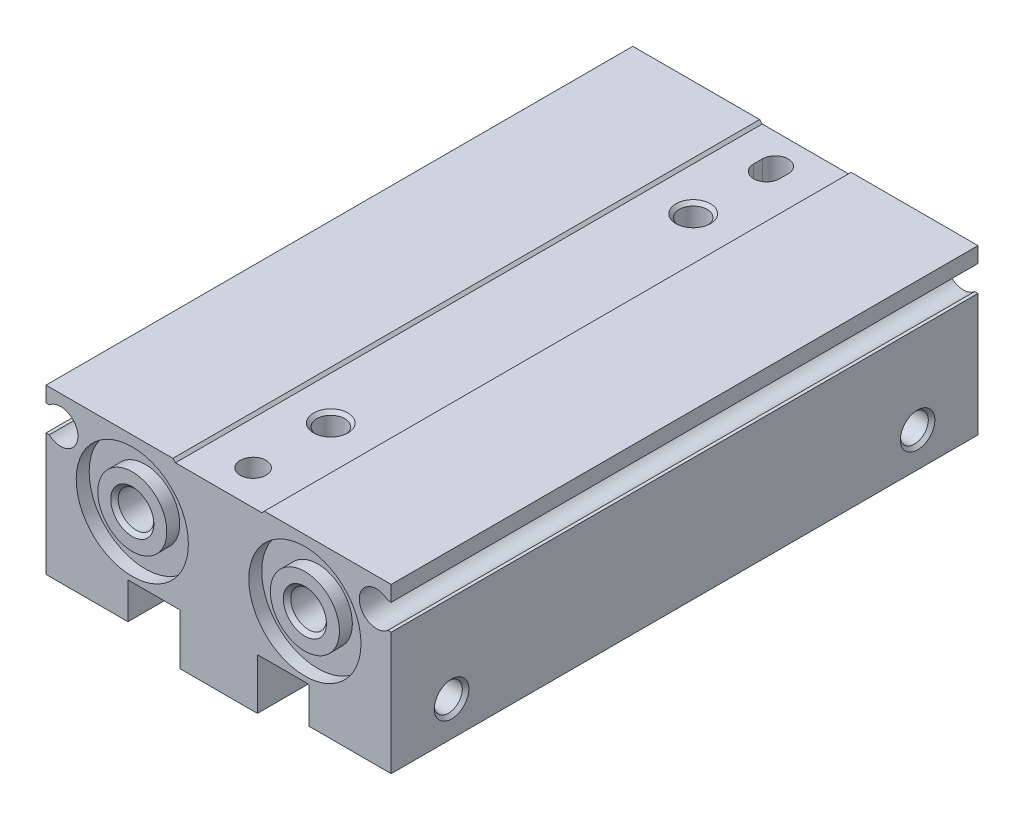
ISO-10303-21;
HEADER;
FILE_DESCRIPTION(('STEP AP214'),'2;1');
FILE_NAME('part.step','',(''),(''),'','','');
FILE_SCHEMA(('AUTOMOTIVE_DESIGN { 1 0 10303 214 1 1 1 1 }'));
ENDSEC;
DATA;
#1=APPLICATION_CONTEXT('core data for automotive mechanical design processes');
#2=APPLICATION_PROTOCOL_DEFINITION('international standard','automotive_design',2000,#1);
#3=PRODUCT_CONTEXT('',#1,'mechanical');
#4=PRODUCT('Part','Part','',(#3));
#5=PRODUCT_RELATED_PRODUCT_CATEGORY('part','',(#4));
#6=PRODUCT_DEFINITION_FORMATION('','',#4);
#7=PRODUCT_DEFINITION_CONTEXT('part definition',#1,'design');
#8=PRODUCT_DEFINITION('design','',#6,#7);
#9=PRODUCT_DEFINITION_SHAPE('','',#8);
#10=(LENGTH_UNIT() NAMED_UNIT(*) SI_UNIT(.MILLI.,.METRE.));
#11=(NAMED_UNIT(*) PLANE_ANGLE_UNIT() SI_UNIT($,.RADIAN.));
#12=(NAMED_UNIT(*) SI_UNIT($,.STERADIAN.) SOLID_ANGLE_UNIT());
#13=UNCERTAINTY_MEASURE_WITH_UNIT(LENGTH_MEASURE(1.E-05),#10,'distance_accuracy_value','');
#14=(GEOMETRIC_REPRESENTATION_CONTEXT(3) GLOBAL_UNCERTAINTY_ASSIGNED_CONTEXT((#13)) GLOBAL_UNIT_ASSIGNED_CONTEXT((#10,
#11,#12)) REPRESENTATION_CONTEXT('',''));
#15=CARTESIAN_POINT('',(0.,0.,0.));
#16=DIRECTION('',(0.,0.,1.));
#17=DIRECTION('',(1.,0.,0.));
#18=AXIS2_PLACEMENT_3D('',#15,#16,#17);
#19=CARTESIAN_POINT('',(4.5,-14.8,-9.));
#20=DIRECTION('',(0.,-1.,0.));
#21=DIRECTION('',(1.,0.,0.));
#22=AXIS2_PLACEMENT_3D('',#19,#20,#21);
#23=PLANE('',#22);
#24=DIRECTION('',(1.,0.,0.));
#25=VECTOR('',#24,1.);
#26=CARTESIAN_POINT('',(4.5,-14.8,-9.));
#27=LINE('',#26,#25);
#28=CARTESIAN_POINT('',(4.5,-14.8,-9.));
#29=VERTEX_POINT('',#28);
#30=CARTESIAN_POINT('',(10.5,-14.8,-9.));
#31=VERTEX_POINT('',#30);
#32=EDGE_CURVE('E251',#29,#31,#27,.T.);
#33=ORIENTED_EDGE('',*,*,#32,.T.);
#34=DIRECTION('',(0.,0.,1.));
#35=VECTOR('',#34,1.);
#36=CARTESIAN_POINT('',(10.5,-14.8,-9.));
#37=LINE('',#36,#35);
#38=CARTESIAN_POINT('',(10.5,-14.8,34.));
#39=VERTEX_POINT('',#38);
#40=EDGE_CURVE('E264',#39,#31,#37,.F.);
#41=ORIENTED_EDGE('',*,*,#40,.F.);
#42=DIRECTION('',(-1.,0.,0.));
#43=VECTOR('',#42,1.);
#44=CARTESIAN_POINT('',(10.5,-14.8,34.));
#45=LINE('',#44,#43);
#46=CARTESIAN_POINT('',(4.5,-14.8,34.));
#47=VERTEX_POINT('',#46);
#48=EDGE_CURVE('E272',#47,#39,#45,.F.);
#49=ORIENTED_EDGE('',*,*,#48,.F.);
#50=DIRECTION('',(0.,0.,-1.));
#51=VECTOR('',#50,1.);
#52=CARTESIAN_POINT('',(4.5,-14.8,34.));
#53=LINE('',#52,#51);
#54=EDGE_CURVE('E266',#47,#29,#53,.T.);
#55=ORIENTED_EDGE('',*,*,#54,.T.);
#56=EDGE_LOOP('',(#33,#41,#49,#55));
#57=FACE_BOUND('',#56,.T.);
#58=ADVANCED_FACE('F16',(#57),#23,.T.);
#59=CARTESIAN_POINT('',(4.5,-14.8,-34.));
#60=DIRECTION('',(0.,-1.,0.));
#61=DIRECTION('',(1.,0.,0.));
#62=AXIS2_PLACEMENT_3D('',#59,#60,#61);
#63=PLANE('',#62);
#64=DIRECTION('',(-1.,0.,0.));
#65=VECTOR('',#64,1.);
#66=CARTESIAN_POINT('',(10.5,-14.8,-22.));
#67=LINE('',#66,#65);
#68=CARTESIAN_POINT('',(10.5,-14.8,-22.));
#69=VERTEX_POINT('',#68);
#70=CARTESIAN_POINT('',(4.5,-14.8,-22.));
#71=VERTEX_POINT('',#70);
#72=EDGE_CURVE('E283',#69,#71,#67,.T.);
#73=ORIENTED_EDGE('',*,*,#72,.T.);
#74=DIRECTION('',(0.,0.,-1.));
#75=VECTOR('',#74,1.);
#76=CARTESIAN_POINT('',(4.5,-14.8,-22.));
#77=LINE('',#76,#75);
#78=CARTESIAN_POINT('',(4.5,-14.8,-34.));
#79=VERTEX_POINT('',#78);
#80=EDGE_CURVE('E288',#71,#79,#77,.T.);
#81=ORIENTED_EDGE('',*,*,#80,.T.);
#82=DIRECTION('',(1.,0.,0.));
#83=VECTOR('',#82,1.);
#84=CARTESIAN_POINT('',(4.5,-14.8,-34.));
#85=LINE('',#84,#83);
#86=CARTESIAN_POINT('',(10.5,-14.8,-34.));
#87=VERTEX_POINT('',#86);
#88=EDGE_CURVE('E293',#79,#87,#85,.T.);
#89=ORIENTED_EDGE('',*,*,#88,.T.);
#90=DIRECTION('',(0.,0.,1.));
#91=VECTOR('',#90,1.);
#92=CARTESIAN_POINT('',(10.5,-14.8,-34.));
#93=LINE('',#92,#91);
#94=EDGE_CURVE('E298',#69,#87,#93,.F.);
#95=ORIENTED_EDGE('',*,*,#94,.F.);
#96=EDGE_LOOP('',(#73,#81,#89,#95));
#97=FACE_BOUND('',#96,.T.);
#98=ADVANCED_FACE('F948',(#97),#63,.T.);
#99=CARTESIAN_POINT('',(-10.5,-14.8,22.));
#100=DIRECTION('',(0.,-1.,0.));
#101=DIRECTION('',(1.,0.,0.));
#102=AXIS2_PLACEMENT_3D('',#99,#100,#101);
#103=PLANE('',#102);
#104=DIRECTION('',(1.,0.,0.));
#105=VECTOR('',#104,1.);
#106=CARTESIAN_POINT('',(-10.5,-14.8,22.));
#107=LINE('',#106,#105);
#108=CARTESIAN_POINT('',(-10.5,-14.8,22.));
#109=VERTEX_POINT('',#108);
#110=CARTESIAN_POINT('',(-4.5,-14.8,22.));
#111=VERTEX_POINT('',#110);
#112=EDGE_CURVE('E303',#109,#111,#107,.T.);
#113=ORIENTED_EDGE('',*,*,#112,.T.);
#114=DIRECTION('',(0.,0.,1.));
#115=VECTOR('',#114,1.);
#116=CARTESIAN_POINT('',(-4.5,-14.8,22.));
#117=LINE('',#116,#115);
#118=CARTESIAN_POINT('',(-4.5,-14.8,34.));
#119=VERTEX_POINT('',#118);
#120=EDGE_CURVE('E308',#119,#111,#117,.F.);
#121=ORIENTED_EDGE('',*,*,#120,.F.);
#122=DIRECTION('',(-1.,0.,0.));
#123=VECTOR('',#122,1.);
#124=CARTESIAN_POINT('',(-4.5,-14.8,34.));
#125=LINE('',#124,#123);
#126=CARTESIAN_POINT('',(-10.5,-14.8,34.));
#127=VERTEX_POINT('',#126);
#128=EDGE_CURVE('E313',#127,#119,#125,.F.);
#129=ORIENTED_EDGE('',*,*,#128,.F.);
#130=DIRECTION('',(0.,0.,-1.));
#131=VECTOR('',#130,1.);
#132=CARTESIAN_POINT('',(-10.5,-14.8,34.));
#133=LINE('',#132,#131);
#134=EDGE_CURVE('E317',#127,#109,#133,.T.);
#135=ORIENTED_EDGE('',*,*,#134,.T.);
#136=EDGE_LOOP('',(#113,#121,#129,#135));
#137=FACE_BOUND('',#136,.T.);
#138=ADVANCED_FACE('F953',(#137),#103,.T.);
#139=CARTESIAN_POINT('',(-10.5,-14.8,-34.));
#140=DIRECTION('',(0.,-1.,0.));
#141=DIRECTION('',(1.,0.,0.));
#142=AXIS2_PLACEMENT_3D('',#139,#140,#141);
#143=PLANE('',#142);
#144=DIRECTION('',(-1.,0.,0.));
#145=VECTOR('',#144,1.);
#146=CARTESIAN_POINT('',(-4.5,-14.8,9.));
#147=LINE('',#146,#145);
#148=CARTESIAN_POINT('',(-4.5,-14.8,9.));
#149=VERTEX_POINT('',#148);
#150=CARTESIAN_POINT('',(-10.5,-14.8,9.));
#151=VERTEX_POINT('',#150);
#152=EDGE_CURVE('E322',#149,#151,#147,.T.);
#153=ORIENTED_EDGE('',*,*,#152,.T.);
#154=DIRECTION('',(0.,0.,-1.));
#155=VECTOR('',#154,1.);
#156=CARTESIAN_POINT('',(-10.5,-14.8,9.));
#157=LINE('',#156,#155);
#158=CARTESIAN_POINT('',(-10.5,-14.8,-34.));
#159=VERTEX_POINT('',#158);
#160=EDGE_CURVE('E327',#151,#159,#157,.T.);
#161=ORIENTED_EDGE('',*,*,#160,.T.);
#162=DIRECTION('',(1.,0.,0.));
#163=VECTOR('',#162,1.);
#164=CARTESIAN_POINT('',(-10.5,-14.8,-34.));
#165=LINE('',#164,#163);
#166=CARTESIAN_POINT('',(-4.5,-14.8,-34.));
#167=VERTEX_POINT('',#166);
#168=EDGE_CURVE('E332',#159,#167,#165,.T.);
#169=ORIENTED_EDGE('',*,*,#168,.T.);
#170=DIRECTION('',(0.,0.,1.));
#171=VECTOR('',#170,1.);
#172=CARTESIAN_POINT('',(-4.5,-14.8,-34.));
#173=LINE('',#172,#171);
#174=EDGE_CURVE('E337',#149,#167,#173,.F.);
#175=ORIENTED_EDGE('',*,*,#174,.F.);
#176=EDGE_LOOP('',(#153,#161,#169,#175));
#177=FACE_BOUND('',#176,.T.);
#178=ADVANCED_FACE('F959',(#177),#143,.T.);
#179=CARTESIAN_POINT('',(-20.,-4.8,34.));
#180=DIRECTION('',(0.,1.,0.));
#181=DIRECTION('',(1.,0.,0.));
#182=AXIS2_PLACEMENT_3D('',#179,#180,#181);
#183=PLANE('',#182);
#184=DIRECTION('',(-1.,0.,0.));
#185=VECTOR('',#184,1.);
#186=CARTESIAN_POINT('',(-19.622875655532,-4.8,-34.));
#187=LINE('',#186,#185);
#188=CARTESIAN_POINT('',(-19.622875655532,-4.8,-34.));
#189=VERTEX_POINT('',#188);
#190=CARTESIAN_POINT('',(-20.,-4.8,-34.));
#191=VERTEX_POINT('',#190);
#192=EDGE_CURVE('E342',#189,#191,#187,.T.);
#193=ORIENTED_EDGE('',*,*,#192,.T.);
#194=DIRECTION('',(0.,0.,1.));
#195=VECTOR('',#194,1.);
#196=CARTESIAN_POINT('',(-20.,-4.8,-34.));
#197=LINE('',#196,#195);
#198=CARTESIAN_POINT('',(-20.,-4.8,34.));
#199=VERTEX_POINT('',#198);
#200=EDGE_CURVE('E347',#199,#191,#197,.F.);
#201=ORIENTED_EDGE('',*,*,#200,.F.);
#202=DIRECTION('',(1.,0.,0.));
#203=VECTOR('',#202,1.);
#204=CARTESIAN_POINT('',(-20.,-4.8,34.));
#205=LINE('',#204,#203);
#206=CARTESIAN_POINT('',(-19.622875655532,-4.8,34.));
#207=VERTEX_POINT('',#206);
#208=EDGE_CURVE('E352',#207,#199,#205,.F.);
#209=ORIENTED_EDGE('',*,*,#208,.F.);
#210=DIRECTION('',(0.,0.,-1.));
#211=VECTOR('',#210,1.);
#212=CARTESIAN_POINT('',(-19.622875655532,-4.8,34.));
#213=LINE('',#212,#211);
#214=EDGE_CURVE('E356',#207,#189,#213,.T.);
#215=ORIENTED_EDGE('',*,*,#214,.T.);
#216=EDGE_LOOP('',(#193,#201,#209,#215));
#217=FACE_BOUND('',#216,.T.);
#218=ADVANCED_FACE('F963',(#217),#183,.T.);
#219=CARTESIAN_POINT('',(-20.,-19.,34.));
#220=DIRECTION('',(-1.,0.,0.));
#221=DIRECTION('',(0.,1.,0.));
#222=AXIS2_PLACEMENT_3D('',#219,#220,#221);
#223=PLANE('',#222);
#224=DIRECTION('',(0.,-1.,0.));
#225=VECTOR('',#224,1.);
#226=CARTESIAN_POINT('',(-20.,-4.8,-34.));
#227=LINE('',#226,#225);
#228=CARTESIAN_POINT('',(-20.,-19.,-34.));
#229=VERTEX_POINT('',#228);
#230=EDGE_CURVE('E361',#191,#229,#227,.T.);
#231=ORIENTED_EDGE('',*,*,#230,.T.);
#232=DIRECTION('',(0.,0.,1.));
#233=VECTOR('',#232,1.);
#234=CARTESIAN_POINT('',(-20.,-19.,-34.));
#235=LINE('',#234,#233);
#236=CARTESIAN_POINT('',(-20.,-19.,34.));
#237=VERTEX_POINT('',#236);
#238=EDGE_CURVE('E366',#237,#229,#235,.F.);
#239=ORIENTED_EDGE('',*,*,#238,.F.);
#240=DIRECTION('',(0.,1.,0.));
#241=VECTOR('',#240,1.);
#242=CARTESIAN_POINT('',(-20.,-19.,34.));
#243=LINE('',#242,#241);
#244=EDGE_CURVE('E371',#199,#237,#243,.F.);
#245=ORIENTED_EDGE('',*,*,#244,.F.);
#246=ORIENTED_EDGE('',*,*,#200,.T.);
#247=EDGE_LOOP('',(#231,#239,#245,#246));
#248=FACE_BOUND('',#247,.T.);
#249=CARTESIAN_POINT('',(-20.,-15.,-27.));
#250=DIRECTION('',(1.,0.,0.));
#251=DIRECTION('',(0.,0.,1.));
#252=AXIS2_PLACEMENT_3D('',#249,#250,#251);
#253=CIRCLE('',#252,2.);
#254=CARTESIAN_POINT('',(-20.,-15.,-25.));
#255=VERTEX_POINT('',#254);
#256=EDGE_CURVE('E375',#255,#255,#253,.F.);
#257=ORIENTED_EDGE('',*,*,#256,.F.);
#258=EDGE_LOOP('',(#257));
#259=FACE_BOUND('',#258,.T.);
#260=CARTESIAN_POINT('',(-20.,-15.,27.));
#261=DIRECTION('',(1.,0.,0.));
#262=DIRECTION('',(0.,0.,1.));
#263=AXIS2_PLACEMENT_3D('',#260,#261,#262);
#264=CIRCLE('',#263,2.);
#265=CARTESIAN_POINT('',(-20.,-15.,29.));
#266=VERTEX_POINT('',#265);
#267=EDGE_CURVE('E380',#266,#266,#264,.F.);
#268=ORIENTED_EDGE('',*,*,#267,.F.);
#269=EDGE_LOOP('',(#268));
#270=FACE_BOUND('',#269,.T.);
#271=ADVANCED_FACE('F967',(#248,#259,#270),#223,.T.);
#272=CARTESIAN_POINT('',(-20.,-19.,-34.));
#273=DIRECTION('',(0.,-1.,0.));
#274=DIRECTION('',(1.,0.,0.));
#275=AXIS2_PLACEMENT_3D('',#272,#273,#274);
#276=PLANE('',#275);
#277=DIRECTION('',(1.,0.,0.));
#278=VECTOR('',#277,1.);
#279=CARTESIAN_POINT('',(-20.,-19.,-34.));
#280=LINE('',#279,#278);
#281=CARTESIAN_POINT('',(-10.5,-19.,-34.));
#282=VERTEX_POINT('',#281);
#283=EDGE_CURVE('E383',#229,#282,#280,.T.);
#284=ORIENTED_EDGE('',*,*,#283,.T.);
#285=DIRECTION('',(0.,0.,1.));
#286=VECTOR('',#285,1.);
#287=CARTESIAN_POINT('',(-10.5,-19.,-34.));
#288=LINE('',#287,#286);
#289=CARTESIAN_POINT('',(-10.5,-19.,34.));
#290=VERTEX_POINT('',#289);
#291=EDGE_CURVE('E386',#290,#282,#288,.F.);
#292=ORIENTED_EDGE('',*,*,#291,.F.);
#293=DIRECTION('',(-1.,0.,0.));
#294=VECTOR('',#293,1.);
#295=CARTESIAN_POINT('',(-10.5,-19.,34.));
#296=LINE('',#295,#294);
#297=EDGE_CURVE('E391',#237,#290,#296,.F.);
#298=ORIENTED_EDGE('',*,*,#297,.F.);
#299=ORIENTED_EDGE('',*,*,#238,.T.);
#300=EDGE_LOOP('',(#284,#292,#298,#299));
#301=FACE_BOUND('',#300,.T.);
#302=CARTESIAN_POINT('',(-16.5,-19.,22.));
#303=DIRECTION('',(0.,1.,0.));
#304=DIRECTION('',(0.,0.,-1.));
#305=AXIS2_PLACEMENT_3D('',#302,#303,#304);
#306=CIRCLE('',#305,2.);
#307=CARTESIAN_POINT('',(-16.5,-19.,20.));
#308=VERTEX_POINT('',#307);
#309=EDGE_CURVE('E395',#308,#308,#306,.T.);
#310=ORIENTED_EDGE('',*,*,#309,.T.);
#311=EDGE_LOOP('',(#310));
#312=FACE_BOUND('',#311,.T.);
#313=CARTESIAN_POINT('',(-16.5,-19.,-22.));
#314=DIRECTION('',(0.,1.,0.));
#315=DIRECTION('',(0.,0.,-1.));
#316=AXIS2_PLACEMENT_3D('',#313,#314,#315);
#317=CIRCLE('',#316,2.);
#318=CARTESIAN_POINT('',(-16.5,-19.,-24.));
#319=VERTEX_POINT('',#318);
#320=EDGE_CURVE('E400',#319,#319,#317,.T.);
#321=ORIENTED_EDGE('',*,*,#320,.T.);
#322=EDGE_LOOP('',(#321));
#323=FACE_BOUND('',#322,.T.);
#324=ADVANCED_FACE('F971',(#301,#312,#323),#276,.T.);
#325=CARTESIAN_POINT('',(-10.5,-19.,-34.));
#326=DIRECTION('',(1.,0.,0.));
#327=DIRECTION('',(0.,1.,0.));
#328=AXIS2_PLACEMENT_3D('',#325,#326,#327);
#329=PLANE('',#328);
#330=DIRECTION('',(0.,1.,0.));
#331=VECTOR('',#330,1.);
#332=CARTESIAN_POINT('',(-10.5,-19.,-34.));
#333=LINE('',#332,#331);
#334=EDGE_CURVE('E403',#282,#159,#333,.T.);
#335=ORIENTED_EDGE('',*,*,#334,.T.);
#336=ORIENTED_EDGE('',*,*,#160,.F.);
#337=DIRECTION('',(0.,1.,0.));
#338=VECTOR('',#337,1.);
#339=CARTESIAN_POINT('',(-10.5,-14.8,9.00000000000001));
#340=LINE('',#339,#338);
#341=CARTESIAN_POINT('',(-10.5,-13.2,9.00000000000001));
#342=VERTEX_POINT('',#341);
#343=EDGE_CURVE('E406',#342,#151,#340,.F.);
#344=ORIENTED_EDGE('',*,*,#343,.F.);
#345=DIRECTION('',(0.,0.,1.));
#346=VECTOR('',#345,1.);
#347=CARTESIAN_POINT('',(-10.5,-13.2,9.00000000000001));
#348=LINE('',#347,#346);
#349=CARTESIAN_POINT('',(-10.5,-13.2,22.));
#350=VERTEX_POINT('',#349);
#351=EDGE_CURVE('E410',#342,#350,#348,.T.);
#352=ORIENTED_EDGE('',*,*,#351,.T.);
#353=DIRECTION('',(0.,-1.,0.));
#354=VECTOR('',#353,1.);
#355=CARTESIAN_POINT('',(-10.5,-13.2,22.));
#356=LINE('',#355,#354);
#357=EDGE_CURVE('E415',#350,#109,#356,.T.);
#358=ORIENTED_EDGE('',*,*,#357,.T.);
#359=ORIENTED_EDGE('',*,*,#134,.F.);
#360=DIRECTION('',(0.,-1.,0.));
#361=VECTOR('',#360,1.);
#362=CARTESIAN_POINT('',(-10.5,-14.8,34.));
#363=LINE('',#362,#361);
#364=EDGE_CURVE('E420',#290,#127,#363,.F.);
#365=ORIENTED_EDGE('',*,*,#364,.F.);
#366=ORIENTED_EDGE('',*,*,#291,.T.);
#367=EDGE_LOOP('',(#335,#336,#344,#352,#358,#359,#365,#366));
#368=FACE_BOUND('',#367,.T.);
#369=ADVANCED_FACE('F975',(#368),#329,.T.);
#370=CARTESIAN_POINT('',(-4.5,-20.7,34.));
#371=DIRECTION('',(-1.,0.,0.));
#372=DIRECTION('',(0.,1.,0.));
#373=AXIS2_PLACEMENT_3D('',#370,#371,#372);
#374=PLANE('',#373);
#375=DIRECTION('',(0.,-1.,0.));
#376=VECTOR('',#375,1.);
#377=CARTESIAN_POINT('',(-4.5,-14.8,-34.));
#378=LINE('',#377,#376);
#379=CARTESIAN_POINT('',(-4.5,-20.7,-34.));
#380=VERTEX_POINT('',#379);
#381=EDGE_CURVE('E424',#167,#380,#378,.T.);
#382=ORIENTED_EDGE('',*,*,#381,.T.);
#383=DIRECTION('',(0.,0.,1.));
#384=VECTOR('',#383,1.);
#385=CARTESIAN_POINT('',(-4.5,-20.7,-34.));
#386=LINE('',#385,#384);
#387=CARTESIAN_POINT('',(-4.5,-20.7,34.));
#388=VERTEX_POINT('',#387);
#389=EDGE_CURVE('E429',#388,#380,#386,.F.);
#390=ORIENTED_EDGE('',*,*,#389,.F.);
#391=DIRECTION('',(0.,1.,0.));
#392=VECTOR('',#391,1.);
#393=CARTESIAN_POINT('',(-4.5,-20.7,34.));
#394=LINE('',#393,#392);
#395=EDGE_CURVE('E434',#119,#388,#394,.F.);
#396=ORIENTED_EDGE('',*,*,#395,.F.);
#397=ORIENTED_EDGE('',*,*,#120,.T.);
#398=DIRECTION('',(0.,1.,0.));
#399=VECTOR('',#398,1.);
#400=CARTESIAN_POINT('',(-4.5,-14.8,22.));
#401=LINE('',#400,#399);
#402=CARTESIAN_POINT('',(-4.5,-13.2,22.));
#403=VERTEX_POINT('',#402);
#404=EDGE_CURVE('E438',#403,#111,#401,.F.);
#405=ORIENTED_EDGE('',*,*,#404,.F.);
#406=DIRECTION('',(0.,0.,-1.));
#407=VECTOR('',#406,1.);
#408=CARTESIAN_POINT('',(-4.5,-13.2,22.));
#409=LINE('',#408,#407);
#410=CARTESIAN_POINT('',(-4.5,-13.2,8.99999999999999));
#411=VERTEX_POINT('',#410);
#412=EDGE_CURVE('E442',#403,#411,#409,.T.);
#413=ORIENTED_EDGE('',*,*,#412,.T.);
#414=DIRECTION('',(0.,-1.,0.));
#415=VECTOR('',#414,1.);
#416=CARTESIAN_POINT('',(-4.5,-13.2,8.99999999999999));
#417=LINE('',#416,#415);
#418=EDGE_CURVE('E447',#411,#149,#417,.T.);
#419=ORIENTED_EDGE('',*,*,#418,.T.);
#420=ORIENTED_EDGE('',*,*,#174,.T.);
#421=EDGE_LOOP('',(#382,#390,#396,#397,#405,#413,#419,#420));
#422=FACE_BOUND('',#421,.T.);
#423=ADVANCED_FACE('F979',(#422),#374,.T.);
#424=CARTESIAN_POINT('',(-4.5,-20.7,-34.));
#425=DIRECTION('',(0.,-1.,0.));
#426=DIRECTION('',(1.,0.,0.));
#427=AXIS2_PLACEMENT_3D('',#424,#425,#426);
#428=PLANE('',#427);
#429=DIRECTION('',(1.,0.,0.));
#430=VECTOR('',#429,1.);
#431=CARTESIAN_POINT('',(-4.5,-20.7,-34.));
#432=LINE('',#431,#430);
#433=CARTESIAN_POINT('',(4.5,-20.7,-34.));
#434=VERTEX_POINT('',#433);
#435=EDGE_CURVE('E452',#380,#434,#432,.T.);
#436=ORIENTED_EDGE('',*,*,#435,.T.);
#437=DIRECTION('',(0.,0.,1.));
#438=VECTOR('',#437,1.);
#439=CARTESIAN_POINT('',(4.5,-20.7,-34.));
#440=LINE('',#439,#438);
#441=CARTESIAN_POINT('',(4.5,-20.7,34.));
#442=VERTEX_POINT('',#441);
#443=EDGE_CURVE('E457',#442,#434,#440,.F.);
#444=ORIENTED_EDGE('',*,*,#443,.F.);
#445=DIRECTION('',(-1.,0.,0.));
#446=VECTOR('',#445,1.);
#447=CARTESIAN_POINT('',(4.5,-20.7,34.));
#448=LINE('',#447,#446);
#449=EDGE_CURVE('E462',#388,#442,#448,.F.);
#450=ORIENTED_EDGE('',*,*,#449,.F.);
#451=ORIENTED_EDGE('',*,*,#389,.T.);
#452=EDGE_LOOP('',(#436,#444,#450,#451));
#453=FACE_BOUND('',#452,.T.);
#454=CARTESIAN_POINT('',(0.,-20.7,-21.));
#455=DIRECTION('',(0.,1.,0.));
#456=DIRECTION('',(0.,0.,-1.));
#457=AXIS2_PLACEMENT_3D('',#454,#455,#456);
#458=CIRCLE('',#457,2.75);
#459=CARTESIAN_POINT('',(0.,-20.7,-23.75));
#460=VERTEX_POINT('',#459);
#461=EDGE_CURVE('E466',#460,#460,#458,.F.);
#462=ORIENTED_EDGE('',*,*,#461,.F.);
#463=EDGE_LOOP('',(#462));
#464=FACE_BOUND('',#463,.T.);
#465=CARTESIAN_POINT('',(0.,-20.7,21.));
#466=DIRECTION('',(0.,1.,0.));
#467=DIRECTION('',(0.,0.,-1.));
#468=AXIS2_PLACEMENT_3D('',#465,#466,#467);
#469=CIRCLE('',#468,2.75);
#470=CARTESIAN_POINT('',(0.,-20.7,18.25));
#471=VERTEX_POINT('',#470);
#472=EDGE_CURVE('E471',#471,#471,#469,.F.);
#473=ORIENTED_EDGE('',*,*,#472,.F.);
#474=EDGE_LOOP('',(#473));
#475=FACE_BOUND('',#474,.T.);
#476=ADVANCED_FACE('F983',(#453,#464,#475),#428,.T.);
#477=CARTESIAN_POINT('',(4.5,-20.7,-34.));
#478=DIRECTION('',(1.,0.,0.));
#479=DIRECTION('',(0.,1.,0.));
#480=AXIS2_PLACEMENT_3D('',#477,#478,#479);
#481=PLANE('',#480);
#482=DIRECTION('',(0.,1.,0.));
#483=VECTOR('',#482,1.);
#484=CARTESIAN_POINT('',(4.5,-20.7,-34.));
#485=LINE('',#484,#483);
#486=EDGE_CURVE('E474',#434,#79,#485,.T.);
#487=ORIENTED_EDGE('',*,*,#486,.T.);
#488=ORIENTED_EDGE('',*,*,#80,.F.);
#489=DIRECTION('',(0.,1.,0.));
#490=VECTOR('',#489,1.);
#491=CARTESIAN_POINT('',(4.5,-14.8,-22.));
#492=LINE('',#491,#490);
#493=CARTESIAN_POINT('',(4.5,-13.2,-22.));
#494=VERTEX_POINT('',#493);
#495=EDGE_CURVE('E477',#494,#71,#492,.F.);
#496=ORIENTED_EDGE('',*,*,#495,.F.);
#497=DIRECTION('',(0.,0.,1.));
#498=VECTOR('',#497,1.);
#499=CARTESIAN_POINT('',(4.5,-13.2,-22.));
#500=LINE('',#499,#498);
#501=CARTESIAN_POINT('',(4.5,-13.2,-8.99999999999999));
#502=VERTEX_POINT('',#501);
#503=EDGE_CURVE('E481',#494,#502,#500,.T.);
#504=ORIENTED_EDGE('',*,*,#503,.T.);
#505=DIRECTION('',(0.,-1.,0.));
#506=VECTOR('',#505,1.);
#507=CARTESIAN_POINT('',(4.5,-13.2,-8.99999999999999));
#508=LINE('',#507,#506);
#509=EDGE_CURVE('E486',#502,#29,#508,.T.);
#510=ORIENTED_EDGE('',*,*,#509,.T.);
#511=ORIENTED_EDGE('',*,*,#54,.F.);
#512=DIRECTION('',(0.,-1.,0.));
#513=VECTOR('',#512,1.);
#514=CARTESIAN_POINT('',(4.5,-14.8,34.));
#515=LINE('',#514,#513);
#516=EDGE_CURVE('E490',#442,#47,#515,.F.);
#517=ORIENTED_EDGE('',*,*,#516,.F.);
#518=ORIENTED_EDGE('',*,*,#443,.T.);
#519=EDGE_LOOP('',(#487,#488,#496,#504,#510,#511,#517,#518));
#520=FACE_BOUND('',#519,.T.);
#521=ADVANCED_FACE('F987',(#520),#481,.T.);
#522=CARTESIAN_POINT('',(10.5,-19.,34.));
#523=DIRECTION('',(-1.,0.,0.));
#524=DIRECTION('',(0.,1.,0.));
#525=AXIS2_PLACEMENT_3D('',#522,#523,#524);
#526=PLANE('',#525);
#527=DIRECTION('',(0.,-1.,0.));
#528=VECTOR('',#527,1.);
#529=CARTESIAN_POINT('',(10.5,-14.8,-34.));
#530=LINE('',#529,#528);
#531=CARTESIAN_POINT('',(10.5,-19.,-34.));
#532=VERTEX_POINT('',#531);
#533=EDGE_CURVE('E494',#87,#532,#530,.T.);
#534=ORIENTED_EDGE('',*,*,#533,.T.);
#535=DIRECTION('',(0.,0.,1.));
#536=VECTOR('',#535,1.);
#537=CARTESIAN_POINT('',(10.5,-19.,-34.));
#538=LINE('',#537,#536);
#539=CARTESIAN_POINT('',(10.5,-19.,34.));
#540=VERTEX_POINT('',#539);
#541=EDGE_CURVE('E498',#540,#532,#538,.F.);
#542=ORIENTED_EDGE('',*,*,#541,.F.);
#543=DIRECTION('',(0.,1.,0.));
#544=VECTOR('',#543,1.);
#545=CARTESIAN_POINT('',(10.5,-19.,34.));
#546=LINE('',#545,#544);
#547=EDGE_CURVE('E258',#39,#540,#546,.F.);
#548=ORIENTED_EDGE('',*,*,#547,.F.);
#549=ORIENTED_EDGE('',*,*,#40,.T.);
#550=DIRECTION('',(0.,1.,0.));
#551=VECTOR('',#550,1.);
#552=CARTESIAN_POINT('',(10.5,-14.8,-9.00000000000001));
#553=LINE('',#552,#551);
#554=CARTESIAN_POINT('',(10.5,-13.2,-9.00000000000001));
#555=VERTEX_POINT('',#554);
#556=EDGE_CURVE('E247',#555,#31,#553,.F.);
#557=ORIENTED_EDGE('',*,*,#556,.F.);
#558=DIRECTION('',(0.,0.,-1.));
#559=VECTOR('',#558,1.);
#560=CARTESIAN_POINT('',(10.5,-13.2,-9.00000000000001));
#561=LINE('',#560,#559);
#562=CARTESIAN_POINT('',(10.5,-13.2,-22.));
#563=VERTEX_POINT('',#562);
#564=EDGE_CURVE('E257',#555,#563,#561,.T.);
#565=ORIENTED_EDGE('',*,*,#564,.T.);
#566=DIRECTION('',(0.,-1.,0.));
#567=VECTOR('',#566,1.);
#568=CARTESIAN_POINT('',(10.5,-13.2,-22.));
#569=LINE('',#568,#567);
#570=EDGE_CURVE('E511',#563,#69,#569,.T.);
#571=ORIENTED_EDGE('',*,*,#570,.T.);
#572=ORIENTED_EDGE('',*,*,#94,.T.);
#573=EDGE_LOOP('',(#534,#542,#548,#549,#557,#565,#571,#572));
#574=FACE_BOUND('',#573,.T.);
#575=ADVANCED_FACE('F270',(#574),#526,.T.);
#576=CARTESIAN_POINT('',(10.5,-19.,-34.));
#577=DIRECTION('',(0.,-1.,0.));
#578=DIRECTION('',(1.,0.,0.));
#579=AXIS2_PLACEMENT_3D('',#576,#577,#578);
#580=PLANE('',#579);
#581=DIRECTION('',(1.,0.,0.));
#582=VECTOR('',#581,1.);
#583=CARTESIAN_POINT('',(10.5,-19.,-34.));
#584=LINE('',#583,#582);
#585=CARTESIAN_POINT('',(20.,-19.,-34.));
#586=VERTEX_POINT('',#585);
#587=EDGE_CURVE('E516',#532,#586,#584,.T.);
#588=ORIENTED_EDGE('',*,*,#587,.T.);
#589=DIRECTION('',(0.,0.,1.));
#590=VECTOR('',#589,1.);
#591=CARTESIAN_POINT('',(20.,-19.,-34.));
#592=LINE('',#591,#590);
#593=CARTESIAN_POINT('',(20.,-19.,34.));
#594=VERTEX_POINT('',#593);
#595=EDGE_CURVE('E521',#594,#586,#592,.F.);
#596=ORIENTED_EDGE('',*,*,#595,.F.);
#597=DIRECTION('',(-1.,0.,0.));
#598=VECTOR('',#597,1.);
#599=CARTESIAN_POINT('',(20.,-19.,34.));
#600=LINE('',#599,#598);
#601=EDGE_CURVE('E526',#540,#594,#600,.F.);
#602=ORIENTED_EDGE('',*,*,#601,.F.);
#603=ORIENTED_EDGE('',*,*,#541,.T.);
#604=EDGE_LOOP('',(#588,#596,#602,#603));
#605=FACE_BOUND('',#604,.T.);
#606=CARTESIAN_POINT('',(16.5,-19.,-22.));
#607=DIRECTION('',(0.,1.,0.));
#608=DIRECTION('',(0.,0.,-1.));
#609=AXIS2_PLACEMENT_3D('',#606,#607,#608);
#610=CIRCLE('',#609,2.);
#611=CARTESIAN_POINT('',(16.5,-19.,-24.));
#612=VERTEX_POINT('',#611);
#613=EDGE_CURVE('E530',#612,#612,#610,.T.);
#614=ORIENTED_EDGE('',*,*,#613,.T.);
#615=EDGE_LOOP('',(#614));
#616=FACE_BOUND('',#615,.T.);
#617=CARTESIAN_POINT('',(16.5,-19.,22.));
#618=DIRECTION('',(0.,1.,0.));
#619=DIRECTION('',(0.,0.,-1.));
#620=AXIS2_PLACEMENT_3D('',#617,#618,#619);
#621=CIRCLE('',#620,2.);
#622=CARTESIAN_POINT('',(16.5,-19.,20.));
#623=VERTEX_POINT('',#622);
#624=EDGE_CURVE('E535',#623,#623,#621,.T.);
#625=ORIENTED_EDGE('',*,*,#624,.T.);
#626=EDGE_LOOP('',(#625));
#627=FACE_BOUND('',#626,.T.);
#628=ADVANCED_FACE('F994',(#605,#616,#627),#580,.T.);
#629=CARTESIAN_POINT('',(20.,-19.,-34.));
#630=DIRECTION('',(1.,0.,0.));
#631=DIRECTION('',(0.,1.,0.));
#632=AXIS2_PLACEMENT_3D('',#629,#630,#631);
#633=PLANE('',#632);
#634=DIRECTION('',(0.,1.,0.));
#635=VECTOR('',#634,1.);
#636=CARTESIAN_POINT('',(20.,-19.,-34.));
#637=LINE('',#636,#635);
#638=CARTESIAN_POINT('',(20.,-4.80000000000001,-34.));
#639=VERTEX_POINT('',#638);
#640=EDGE_CURVE('E538',#586,#639,#637,.T.);
#641=ORIENTED_EDGE('',*,*,#640,.T.);
#642=DIRECTION('',(0.,0.,1.));
#643=VECTOR('',#642,1.);
#644=CARTESIAN_POINT('',(20.,-4.80000000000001,-34.));
#645=LINE('',#644,#643);
#646=CARTESIAN_POINT('',(20.,-4.80000000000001,34.));
#647=VERTEX_POINT('',#646);
#648=EDGE_CURVE('E541',#647,#639,#645,.F.);
#649=ORIENTED_EDGE('',*,*,#648,.F.);
#650=DIRECTION('',(0.,-1.,0.));
#651=VECTOR('',#650,1.);
#652=CARTESIAN_POINT('',(20.,-4.80000000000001,34.));
#653=LINE('',#652,#651);
#654=EDGE_CURVE('E546',#594,#647,#653,.F.);
#655=ORIENTED_EDGE('',*,*,#654,.F.);
#656=ORIENTED_EDGE('',*,*,#595,.T.);
#657=EDGE_LOOP('',(#641,#649,#655,#656));
#658=FACE_BOUND('',#657,.T.);
#659=CARTESIAN_POINT('',(20.,-15.,-27.));
#660=DIRECTION('',(-1.,0.,0.));
#661=DIRECTION('',(0.,0.,-1.));
#662=AXIS2_PLACEMENT_3D('',#659,#660,#661);
#663=CIRCLE('',#662,2.);
#664=CARTESIAN_POINT('',(20.,-15.,-29.));
#665=VERTEX_POINT('',#664);
#666=EDGE_CURVE('E550',#665,#665,#663,.T.);
#667=ORIENTED_EDGE('',*,*,#666,.T.);
#668=EDGE_LOOP('',(#667));
#669=FACE_BOUND('',#668,.T.);
#670=CARTESIAN_POINT('',(20.,-15.,27.));
#671=DIRECTION('',(-1.,0.,0.));
#672=DIRECTION('',(0.,0.,-1.));
#673=AXIS2_PLACEMENT_3D('',#670,#671,#672);
#674=CIRCLE('',#673,2.);
#675=CARTESIAN_POINT('',(20.,-15.,25.));
#676=VERTEX_POINT('',#675);
#677=EDGE_CURVE('E555',#676,#676,#674,.T.);
#678=ORIENTED_EDGE('',*,*,#677,.T.);
#679=EDGE_LOOP('',(#678));
#680=FACE_BOUND('',#679,.T.);
#681=ADVANCED_FACE('F997',(#658,#669,#680),#633,.T.);
#682=CARTESIAN_POINT('',(19.622875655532,-4.8,34.));
#683=DIRECTION('',(0.,1.,0.));
#684=DIRECTION('',(1.,0.,0.));
#685=AXIS2_PLACEMENT_3D('',#682,#683,#684);
#686=PLANE('',#685);
#687=DIRECTION('',(-1.,0.,0.));
#688=VECTOR('',#687,1.);
#689=CARTESIAN_POINT('',(20.,-4.8,-34.));
#690=LINE('',#689,#688);
#691=CARTESIAN_POINT('',(19.622875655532,-4.8,-34.));
#692=VERTEX_POINT('',#691);
#693=EDGE_CURVE('E558',#639,#692,#690,.T.);
#694=ORIENTED_EDGE('',*,*,#693,.T.);
#695=DIRECTION('',(0.,0.,1.));
#696=VECTOR('',#695,1.);
#697=CARTESIAN_POINT('',(19.622875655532,-4.8,-34.));
#698=LINE('',#697,#696);
#699=CARTESIAN_POINT('',(19.622875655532,-4.8,34.));
#700=VERTEX_POINT('',#699);
#701=EDGE_CURVE('E561',#700,#692,#698,.F.);
#702=ORIENTED_EDGE('',*,*,#701,.F.);
#703=DIRECTION('',(1.,0.,0.));
#704=VECTOR('',#703,1.);
#705=CARTESIAN_POINT('',(19.622875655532,-4.8,34.));
#706=LINE('',#705,#704);
#707=EDGE_CURVE('E566',#647,#700,#706,.F.);
#708=ORIENTED_EDGE('',*,*,#707,.F.);
#709=ORIENTED_EDGE('',*,*,#648,.T.);
#710=EDGE_LOOP('',(#694,#702,#708,#709));
#711=FACE_BOUND('',#710,.T.);
#712=ADVANCED_FACE('F1001',(#711),#686,.T.);
#713=CARTESIAN_POINT('',(18.3,-3.3,34.));
#714=DIRECTION('',(0.,0.,-1.));
#715=DIRECTION('',(0.661437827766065,-0.750000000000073,0.));
#716=AXIS2_PLACEMENT_3D('',#713,#714,#715);
#717=CYLINDRICAL_SURFACE('',#716,1.99999999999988);
#718=ORIENTED_EDGE('',*,*,#701,.T.);
#719=CARTESIAN_POINT('',(18.3,-3.3,-34.));
#720=DIRECTION('',(0.,0.,-1.));
#721=DIRECTION('',(0.661437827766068,-0.75000000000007,0.));
#722=AXIS2_PLACEMENT_3D('',#719,#720,#721);
#723=CIRCLE('',#722,1.99999999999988);
#724=CARTESIAN_POINT('',(19.6228756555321,-1.79999999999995,-34.));
#725=VERTEX_POINT('',#724);
#726=EDGE_CURVE('E570',#725,#692,#723,.F.);
#727=ORIENTED_EDGE('',*,*,#726,.F.);
#728=DIRECTION('',(0.,0.,1.));
#729=VECTOR('',#728,1.);
#730=CARTESIAN_POINT('',(19.6228756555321,-1.79999999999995,-34.));
#731=LINE('',#730,#729);
#732=CARTESIAN_POINT('',(19.6228756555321,-1.79999999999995,34.));
#733=VERTEX_POINT('',#732);
#734=EDGE_CURVE('E574',#733,#725,#731,.F.);
#735=ORIENTED_EDGE('',*,*,#734,.F.);
#736=CARTESIAN_POINT('',(18.3,-3.3,34.));
#737=DIRECTION('',(0.,0.,1.));
#738=DIRECTION('',(0.661437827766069,0.750000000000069,0.));
#739=AXIS2_PLACEMENT_3D('',#736,#737,#738);
#740=CIRCLE('',#739,1.99999999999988);
#741=EDGE_CURVE('E579',#733,#700,#740,.T.);
#742=ORIENTED_EDGE('',*,*,#741,.T.);
#743=EDGE_LOOP('',(#718,#727,#735,#742));
#744=FACE_BOUND('',#743,.T.);
#745=ADVANCED_FACE('F1005',(#744),#717,.F.);
#746=CARTESIAN_POINT('',(19.622875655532,-1.8,-34.));
#747=DIRECTION('',(0.,-1.,0.));
#748=DIRECTION('',(1.,0.,0.));
#749=AXIS2_PLACEMENT_3D('',#746,#747,#748);
#750=PLANE('',#749);
#751=DIRECTION('',(1.,0.,0.));
#752=VECTOR('',#751,1.);
#753=CARTESIAN_POINT('',(19.6228756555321,-1.8,-34.));
#754=LINE('',#753,#752);
#755=CARTESIAN_POINT('',(20.,-1.8,-34.));
#756=VERTEX_POINT('',#755);
#757=EDGE_CURVE('E584',#725,#756,#754,.T.);
#758=ORIENTED_EDGE('',*,*,#757,.T.);
#759=DIRECTION('',(0.,0.,1.));
#760=VECTOR('',#759,1.);
#761=CARTESIAN_POINT('',(20.,-1.8,-34.));
#762=LINE('',#761,#760);
#763=CARTESIAN_POINT('',(20.,-1.8,34.));
#764=VERTEX_POINT('',#763);
#765=EDGE_CURVE('E589',#764,#756,#762,.F.);
#766=ORIENTED_EDGE('',*,*,#765,.F.);
#767=DIRECTION('',(-1.,0.,0.));
#768=VECTOR('',#767,1.);
#769=CARTESIAN_POINT('',(20.,-1.8,34.));
#770=LINE('',#769,#768);
#771=EDGE_CURVE('E594',#733,#764,#770,.F.);
#772=ORIENTED_EDGE('',*,*,#771,.F.);
#773=ORIENTED_EDGE('',*,*,#734,.T.);
#774=EDGE_LOOP('',(#758,#766,#772,#773));
#775=FACE_BOUND('',#774,.T.);
#776=ADVANCED_FACE('F1009',(#775),#750,.T.);
#777=CARTESIAN_POINT('',(20.,-1.8,-34.));
#778=DIRECTION('',(1.,0.,0.));
#779=DIRECTION('',(0.,1.,0.));
#780=AXIS2_PLACEMENT_3D('',#777,#778,#779);
#781=PLANE('',#780);
#782=DIRECTION('',(0.,1.,0.));
#783=VECTOR('',#782,1.);
#784=CARTESIAN_POINT('',(20.,-1.8,-34.));
#785=LINE('',#784,#783);
#786=CARTESIAN_POINT('',(20.,0.,-34.));
#787=VERTEX_POINT('',#786);
#788=EDGE_CURVE('E598',#756,#787,#785,.T.);
#789=ORIENTED_EDGE('',*,*,#788,.T.);
#790=DIRECTION('',(0.,0.,1.));
#791=VECTOR('',#790,1.);
#792=CARTESIAN_POINT('',(20.,0.,-34.));
#793=LINE('',#792,#791);
#794=CARTESIAN_POINT('',(20.,0.,34.));
#795=VERTEX_POINT('',#794);
#796=EDGE_CURVE('E603',#795,#787,#793,.F.);
#797=ORIENTED_EDGE('',*,*,#796,.F.);
#798=DIRECTION('',(0.,-1.,0.));
#799=VECTOR('',#798,1.);
#800=CARTESIAN_POINT('',(20.,0.,34.));
#801=LINE('',#800,#799);
#802=EDGE_CURVE('E608',#764,#795,#801,.F.);
#803=ORIENTED_EDGE('',*,*,#802,.F.);
#804=ORIENTED_EDGE('',*,*,#765,.T.);
#805=EDGE_LOOP('',(#789,#797,#803,#804));
#806=FACE_BOUND('',#805,.T.);
#807=ADVANCED_FACE('F1013',(#806),#781,.T.);
#808=CARTESIAN_POINT('',(5.3,0.,34.));
#809=DIRECTION('',(0.,1.,0.));
#810=DIRECTION('',(1.,0.,0.));
#811=AXIS2_PLACEMENT_3D('',#808,#809,#810);
#812=PLANE('',#811);
#813=DIRECTION('',(-1.,0.,0.));
#814=VECTOR('',#813,1.);
#815=CARTESIAN_POINT('',(20.,0.,-34.));
#816=LINE('',#815,#814);
#817=CARTESIAN_POINT('',(5.3,0.,-34.));
#818=VERTEX_POINT('',#817);
#819=EDGE_CURVE('E612',#787,#818,#816,.T.);
#820=ORIENTED_EDGE('',*,*,#819,.T.);
#821=DIRECTION('',(0.,0.,1.));
#822=VECTOR('',#821,1.);
#823=CARTESIAN_POINT('',(5.3,0.,-34.));
#824=LINE('',#823,#822);
#825=CARTESIAN_POINT('',(5.3,0.,34.));
#826=VERTEX_POINT('',#825);
#827=EDGE_CURVE('E617',#826,#818,#824,.F.);
#828=ORIENTED_EDGE('',*,*,#827,.F.);
#829=DIRECTION('',(1.,0.,0.));
#830=VECTOR('',#829,1.);
#831=CARTESIAN_POINT('',(5.3,0.,34.));
#832=LINE('',#831,#830);
#833=EDGE_CURVE('E622',#795,#826,#832,.F.);
#834=ORIENTED_EDGE('',*,*,#833,.F.);
#835=ORIENTED_EDGE('',*,*,#796,.T.);
#836=EDGE_LOOP('',(#820,#828,#834,#835));
#837=FACE_BOUND('',#836,.T.);
#838=ADVANCED_FACE('F1017',(#837),#812,.T.);
#839=CARTESIAN_POINT('',(5.,-0.3,-34.));
#840=DIRECTION('',(-0.707106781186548,0.707106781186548,0.));
#841=DIRECTION('',(0.,0.,1.));
#842=AXIS2_PLACEMENT_3D('',#839,#840,#841);
#843=PLANE('',#842);
#844=DIRECTION('',(-0.707106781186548,-0.707106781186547,0.));
#845=VECTOR('',#844,1.);
#846=CARTESIAN_POINT('',(5.3,0.,-34.));
#847=LINE('',#846,#845);
#848=CARTESIAN_POINT('',(5.,-0.299999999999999,-34.));
#849=VERTEX_POINT('',#848);
#850=EDGE_CURVE('E626',#818,#849,#847,.T.);
#851=ORIENTED_EDGE('',*,*,#850,.T.);
#852=DIRECTION('',(0.,0.,1.));
#853=VECTOR('',#852,1.);
#854=CARTESIAN_POINT('',(5.,-0.299999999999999,-34.));
#855=LINE('',#854,#853);
#856=CARTESIAN_POINT('',(5.,-0.3,34.));
#857=VERTEX_POINT('',#856);
#858=EDGE_CURVE('E631',#857,#849,#855,.F.);
#859=ORIENTED_EDGE('',*,*,#858,.F.);
#860=DIRECTION('',(0.707106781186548,0.707106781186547,0.));
#861=VECTOR('',#860,1.);
#862=CARTESIAN_POINT('',(5.,-0.3,34.));
#863=LINE('',#862,#861);
#864=EDGE_CURVE('E636',#826,#857,#863,.F.);
#865=ORIENTED_EDGE('',*,*,#864,.F.);
#866=ORIENTED_EDGE('',*,*,#827,.T.);
#867=EDGE_LOOP('',(#851,#859,#865,#866));
#868=FACE_BOUND('',#867,.T.);
#869=ADVANCED_FACE('F1021',(#868),#843,.T.);
#870=CARTESIAN_POINT('',(-5.,-0.3,34.));
#871=DIRECTION('',(0.,1.,0.));
#872=DIRECTION('',(1.,0.,0.));
#873=AXIS2_PLACEMENT_3D('',#870,#871,#872);
#874=PLANE('',#873);
#875=DIRECTION('',(-1.,0.,0.));
#876=VECTOR('',#875,1.);
#877=CARTESIAN_POINT('',(5.,-0.3,-34.));
#878=LINE('',#877,#876);
#879=CARTESIAN_POINT('',(-5.,-0.3,-34.));
#880=VERTEX_POINT('',#879);
#881=EDGE_CURVE('E640',#849,#880,#878,.T.);
#882=ORIENTED_EDGE('',*,*,#881,.T.);
#883=DIRECTION('',(0.,0.,1.));
#884=VECTOR('',#883,1.);
#885=CARTESIAN_POINT('',(-5.,-0.3,-34.));
#886=LINE('',#885,#884);
#887=CARTESIAN_POINT('',(-5.,-0.3,34.));
#888=VERTEX_POINT('',#887);
#889=EDGE_CURVE('E645',#888,#880,#886,.F.);
#890=ORIENTED_EDGE('',*,*,#889,.F.);
#891=DIRECTION('',(1.,0.,0.));
#892=VECTOR('',#891,1.);
#893=CARTESIAN_POINT('',(-5.,-0.3,34.));
#894=LINE('',#893,#892);
#895=EDGE_CURVE('E650',#857,#888,#894,.F.);
#896=ORIENTED_EDGE('',*,*,#895,.F.);
#897=ORIENTED_EDGE('',*,*,#858,.T.);
#898=EDGE_LOOP('',(#882,#890,#896,#897));
#899=FACE_BOUND('',#898,.T.);
#900=CARTESIAN_POINT('',(0.,-0.3,-21.));
#901=DIRECTION('',(0.,-1.,0.));
#902=DIRECTION('',(0.,0.,1.));
#903=AXIS2_PLACEMENT_3D('',#900,#901,#902);
#904=CIRCLE('',#903,2.);
#905=CARTESIAN_POINT('',(0.,-0.3,-19.));
#906=VERTEX_POINT('',#905);
#907=EDGE_CURVE('E654',#906,#906,#904,.T.);
#908=ORIENTED_EDGE('',*,*,#907,.T.);
#909=EDGE_LOOP('',(#908));
#910=FACE_BOUND('',#909,.T.);
#911=CARTESIAN_POINT('',(0.,-0.3,21.));
#912=DIRECTION('',(0.,-1.,0.));
#913=DIRECTION('',(0.,0.,1.));
#914=AXIS2_PLACEMENT_3D('',#911,#912,#913);
#915=CIRCLE('',#914,2.);
#916=CARTESIAN_POINT('',(0.,-0.3,23.));
#917=VERTEX_POINT('',#916);
#918=EDGE_CURVE('E659',#917,#917,#915,.T.);
#919=ORIENTED_EDGE('',*,*,#918,.T.);
#920=EDGE_LOOP('',(#919));
#921=FACE_BOUND('',#920,.T.);
#922=CARTESIAN_POINT('',(0.,-0.3,-29.5));
#923=DIRECTION('',(0.,-1.,0.));
#924=DIRECTION('',(1.,0.,0.));
#925=AXIS2_PLACEMENT_3D('',#922,#923,#924);
#926=CIRCLE('',#925,1.5);
#927=CARTESIAN_POINT('',(-1.5,-0.3,-29.5));
#928=VERTEX_POINT('',#927);
#929=CARTESIAN_POINT('',(1.5,-0.3,-29.5));
#930=VERTEX_POINT('',#929);
#931=EDGE_CURVE('E662',#928,#930,#926,.F.);
#932=ORIENTED_EDGE('',*,*,#931,.F.);
#933=DIRECTION('',(0.,0.,-1.));
#934=VECTOR('',#933,1.);
#935=CARTESIAN_POINT('',(-1.5,-0.3,-29.5));
#936=LINE('',#935,#934);
#937=CARTESIAN_POINT('',(-1.5,-0.3,-30.5));
#938=VERTEX_POINT('',#937);
#939=EDGE_CURVE('E665',#938,#928,#936,.F.);
#940=ORIENTED_EDGE('',*,*,#939,.F.);
#941=CARTESIAN_POINT('',(0.,-0.3,-30.5));
#942=DIRECTION('',(0.,-1.,0.));
#943=DIRECTION('',(-1.,0.,0.));
#944=AXIS2_PLACEMENT_3D('',#941,#942,#943);
#945=CIRCLE('',#944,1.5);
#946=CARTESIAN_POINT('',(1.5,-0.3,-30.5));
#947=VERTEX_POINT('',#946);
#948=EDGE_CURVE('E670',#947,#938,#945,.F.);
#949=ORIENTED_EDGE('',*,*,#948,.F.);
#950=DIRECTION('',(0.,0.,1.));
#951=VECTOR('',#950,1.);
#952=CARTESIAN_POINT('',(1.5,-0.3,-30.5));
#953=LINE('',#952,#951);
#954=EDGE_CURVE('E674',#930,#947,#953,.F.);
#955=ORIENTED_EDGE('',*,*,#954,.F.);
#956=EDGE_LOOP('',(#932,#940,#949,#955));
#957=FACE_BOUND('',#956,.T.);
#958=CARTESIAN_POINT('',(0.,-0.3,30.));
#959=DIRECTION('',(0.,-1.,0.));
#960=DIRECTION('',(0.,0.,1.));
#961=AXIS2_PLACEMENT_3D('',#958,#959,#960);
#962=CIRCLE('',#961,1.5);
#963=CARTESIAN_POINT('',(0.,-0.3,31.5));
#964=VERTEX_POINT('',#963);
#965=EDGE_CURVE('E679',#964,#964,#962,.F.);
#966=ORIENTED_EDGE('',*,*,#965,.F.);
#967=EDGE_LOOP('',(#966));
#968=FACE_BOUND('',#967,.T.);
#969=ADVANCED_FACE('F1025',(#899,#910,#921,#957,#968),#874,.T.);
#970=CARTESIAN_POINT('',(-5.3,0.,-34.));
#971=DIRECTION('',(0.707106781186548,0.707106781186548,0.));
#972=DIRECTION('',(0.,0.,1.));
#973=AXIS2_PLACEMENT_3D('',#970,#971,#972);
#974=PLANE('',#973);
#975=DIRECTION('',(-0.707106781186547,0.707106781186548,0.));
#976=VECTOR('',#975,1.);
#977=CARTESIAN_POINT('',(-5.,-0.3,-34.));
#978=LINE('',#977,#976);
#979=CARTESIAN_POINT('',(-5.3,0.,-34.));
#980=VERTEX_POINT('',#979);
#981=EDGE_CURVE('E684',#880,#980,#978,.T.);
#982=ORIENTED_EDGE('',*,*,#981,.T.);
#983=DIRECTION('',(0.,0.,1.));
#984=VECTOR('',#983,1.);
#985=CARTESIAN_POINT('',(-5.3,0.,-34.));
#986=LINE('',#985,#984);
#987=CARTESIAN_POINT('',(-5.3,0.,34.));
#988=VERTEX_POINT('',#987);
#989=EDGE_CURVE('E687',#988,#980,#986,.F.);
#990=ORIENTED_EDGE('',*,*,#989,.F.);
#991=DIRECTION('',(0.707106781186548,-0.707106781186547,0.));
#992=VECTOR('',#991,1.);
#993=CARTESIAN_POINT('',(-5.3,0.,34.));
#994=LINE('',#993,#992);
#995=EDGE_CURVE('E692',#888,#988,#994,.F.);
#996=ORIENTED_EDGE('',*,*,#995,.F.);
#997=ORIENTED_EDGE('',*,*,#889,.T.);
#998=EDGE_LOOP('',(#982,#990,#996,#997));
#999=FACE_BOUND('',#998,.T.);
#1000=ADVANCED_FACE('F1029',(#999),#974,.T.);
#1001=CARTESIAN_POINT('',(-20.,0.,34.));
#1002=DIRECTION('',(0.,1.,0.));
#1003=DIRECTION('',(1.,0.,0.));
#1004=AXIS2_PLACEMENT_3D('',#1001,#1002,#1003);
#1005=PLANE('',#1004);
#1006=DIRECTION('',(-1.,0.,0.));
#1007=VECTOR('',#1006,1.);
#1008=CARTESIAN_POINT('',(-5.3,0.,-34.));
#1009=LINE('',#1008,#1007);
#1010=CARTESIAN_POINT('',(-20.,0.,-34.));
#1011=VERTEX_POINT('',#1010);
#1012=EDGE_CURVE('E696',#980,#1011,#1009,.T.);
#1013=ORIENTED_EDGE('',*,*,#1012,.T.);
#1014=DIRECTION('',(0.,0.,1.));
#1015=VECTOR('',#1014,1.);
#1016=CARTESIAN_POINT('',(-20.,0.,-34.));
#1017=LINE('',#1016,#1015);
#1018=CARTESIAN_POINT('',(-20.,0.,34.));
#1019=VERTEX_POINT('',#1018);
#1020=EDGE_CURVE('E701',#1019,#1011,#1017,.F.);
#1021=ORIENTED_EDGE('',*,*,#1020,.F.);
#1022=DIRECTION('',(1.,0.,0.));
#1023=VECTOR('',#1022,1.);
#1024=CARTESIAN_POINT('',(-20.,0.,34.));
#1025=LINE('',#1024,#1023);
#1026=EDGE_CURVE('E706',#988,#1019,#1025,.F.);
#1027=ORIENTED_EDGE('',*,*,#1026,.F.);
#1028=ORIENTED_EDGE('',*,*,#989,.T.);
#1029=EDGE_LOOP('',(#1013,#1021,#1027,#1028));
#1030=FACE_BOUND('',#1029,.T.);
#1031=ADVANCED_FACE('F1033',(#1030),#1005,.T.);
#1032=CARTESIAN_POINT('',(-20.,-1.8,34.));
#1033=DIRECTION('',(-1.,0.,0.));
#1034=DIRECTION('',(0.,1.,0.));
#1035=AXIS2_PLACEMENT_3D('',#1032,#1033,#1034);
#1036=PLANE('',#1035);
#1037=DIRECTION('',(0.,-1.,0.));
#1038=VECTOR('',#1037,1.);
#1039=CARTESIAN_POINT('',(-20.,0.,-34.));
#1040=LINE('',#1039,#1038);
#1041=CARTESIAN_POINT('',(-20.,-1.8,-34.));
#1042=VERTEX_POINT('',#1041);
#1043=EDGE_CURVE('E710',#1011,#1042,#1040,.T.);
#1044=ORIENTED_EDGE('',*,*,#1043,.T.);
#1045=DIRECTION('',(0.,0.,1.));
#1046=VECTOR('',#1045,1.);
#1047=CARTESIAN_POINT('',(-20.,-1.8,-34.));
#1048=LINE('',#1047,#1046);
#1049=CARTESIAN_POINT('',(-20.,-1.8,34.));
#1050=VERTEX_POINT('',#1049);
#1051=EDGE_CURVE('E715',#1050,#1042,#1048,.F.);
#1052=ORIENTED_EDGE('',*,*,#1051,.F.);
#1053=DIRECTION('',(0.,1.,0.));
#1054=VECTOR('',#1053,1.);
#1055=CARTESIAN_POINT('',(-20.,-1.8,34.));
#1056=LINE('',#1055,#1054);
#1057=EDGE_CURVE('E720',#1019,#1050,#1056,.F.);
#1058=ORIENTED_EDGE('',*,*,#1057,.F.);
#1059=ORIENTED_EDGE('',*,*,#1020,.T.);
#1060=EDGE_LOOP('',(#1044,#1052,#1058,#1059));
#1061=FACE_BOUND('',#1060,.T.);
#1062=ADVANCED_FACE('F1037',(#1061),#1036,.T.);
#1063=CARTESIAN_POINT('',(-20.,-1.8,-34.));
#1064=DIRECTION('',(0.,-1.,0.));
#1065=DIRECTION('',(1.,0.,0.));
#1066=AXIS2_PLACEMENT_3D('',#1063,#1064,#1065);
#1067=PLANE('',#1066);
#1068=DIRECTION('',(1.,0.,0.));
#1069=VECTOR('',#1068,1.);
#1070=CARTESIAN_POINT('',(-20.,-1.8,-34.));
#1071=LINE('',#1070,#1069);
#1072=CARTESIAN_POINT('',(-19.622875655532,-1.8,-34.));
#1073=VERTEX_POINT('',#1072);
#1074=EDGE_CURVE('E724',#1042,#1073,#1071,.T.);
#1075=ORIENTED_EDGE('',*,*,#1074,.T.);
#1076=DIRECTION('',(0.,0.,1.));
#1077=VECTOR('',#1076,1.);
#1078=CARTESIAN_POINT('',(-19.622875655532,-1.8,-34.));
#1079=LINE('',#1078,#1077);
#1080=CARTESIAN_POINT('',(-19.622875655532,-1.8,34.));
#1081=VERTEX_POINT('',#1080);
#1082=EDGE_CURVE('E729',#1081,#1073,#1079,.F.);
#1083=ORIENTED_EDGE('',*,*,#1082,.F.);
#1084=DIRECTION('',(-1.,0.,0.));
#1085=VECTOR('',#1084,1.);
#1086=CARTESIAN_POINT('',(-19.622875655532,-1.8,34.));
#1087=LINE('',#1086,#1085);
#1088=EDGE_CURVE('E734',#1050,#1081,#1087,.F.);
#1089=ORIENTED_EDGE('',*,*,#1088,.F.);
#1090=ORIENTED_EDGE('',*,*,#1051,.T.);
#1091=EDGE_LOOP('',(#1075,#1083,#1089,#1090));
#1092=FACE_BOUND('',#1091,.T.);
#1093=ADVANCED_FACE('F1041',(#1092),#1067,.T.);
#1094=CARTESIAN_POINT('',(-18.3,-3.3,34.));
#1095=DIRECTION('',(0.,0.,-1.));
#1096=DIRECTION('',(-0.661437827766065,0.750000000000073,0.));
#1097=AXIS2_PLACEMENT_3D('',#1094,#1095,#1096);
#1098=CYLINDRICAL_SURFACE('',#1097,1.99999999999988);
#1099=ORIENTED_EDGE('',*,*,#1082,.T.);
#1100=CARTESIAN_POINT('',(-18.3,-3.3,-34.));
#1101=DIRECTION('',(0.,0.,-1.));
#1102=DIRECTION('',(-0.661437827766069,0.75000000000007,0.));
#1103=AXIS2_PLACEMENT_3D('',#1100,#1101,#1102);
#1104=CIRCLE('',#1103,1.99999999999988);
#1105=EDGE_CURVE('E738',#189,#1073,#1104,.F.);
#1106=ORIENTED_EDGE('',*,*,#1105,.F.);
#1107=ORIENTED_EDGE('',*,*,#214,.F.);
#1108=CARTESIAN_POINT('',(-18.3,-3.3,34.));
#1109=DIRECTION('',(0.,0.,1.));
#1110=DIRECTION('',(-0.661437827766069,-0.750000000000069,0.));
#1111=AXIS2_PLACEMENT_3D('',#1108,#1109,#1110);
#1112=CIRCLE('',#1111,1.99999999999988);
#1113=EDGE_CURVE('E742',#207,#1081,#1112,.T.);
#1114=ORIENTED_EDGE('',*,*,#1113,.T.);
#1115=EDGE_LOOP('',(#1099,#1106,#1107,#1114));
#1116=FACE_BOUND('',#1115,.T.);
#1117=ADVANCED_FACE('F1045',(#1116),#1098,.F.);
#1118=CARTESIAN_POINT('',(-20.,-20.7,34.));
#1119=DIRECTION('',(0.,0.,1.));
#1120=DIRECTION('',(1.,0.,0.));
#1121=AXIS2_PLACEMENT_3D('',#1118,#1119,#1120);
#1122=PLANE('',#1121);
#1123=ORIENTED_EDGE('',*,*,#1113,.F.);
#1124=ORIENTED_EDGE('',*,*,#208,.T.);
#1125=ORIENTED_EDGE('',*,*,#244,.T.);
#1126=ORIENTED_EDGE('',*,*,#297,.T.);
#1127=ORIENTED_EDGE('',*,*,#364,.T.);
#1128=ORIENTED_EDGE('',*,*,#128,.T.);
#1129=ORIENTED_EDGE('',*,*,#395,.T.);
#1130=ORIENTED_EDGE('',*,*,#449,.T.);
#1131=ORIENTED_EDGE('',*,*,#516,.T.);
#1132=ORIENTED_EDGE('',*,*,#48,.T.);
#1133=ORIENTED_EDGE('',*,*,#547,.T.);
#1134=ORIENTED_EDGE('',*,*,#601,.T.);
#1135=ORIENTED_EDGE('',*,*,#654,.T.);
#1136=ORIENTED_EDGE('',*,*,#707,.T.);
#1137=ORIENTED_EDGE('',*,*,#741,.F.);
#1138=ORIENTED_EDGE('',*,*,#771,.T.);
#1139=ORIENTED_EDGE('',*,*,#802,.T.);
#1140=ORIENTED_EDGE('',*,*,#833,.T.);
#1141=ORIENTED_EDGE('',*,*,#864,.T.);
#1142=ORIENTED_EDGE('',*,*,#895,.T.);
#1143=ORIENTED_EDGE('',*,*,#995,.T.);
#1144=ORIENTED_EDGE('',*,*,#1026,.T.);
#1145=ORIENTED_EDGE('',*,*,#1057,.T.);
#1146=ORIENTED_EDGE('',*,*,#1088,.T.);
#1147=EDGE_LOOP('',(#1123,#1124,#1125,#1126,#1127,#1128,#1129,#1130,#1131,#1132,#1133,#1134,
#1135,#1136,#1137,#1138,#1139,#1140,#1141,#1142,#1143,#1144,#1145,#1146));
#1148=FACE_BOUND('',#1147,.T.);
#1149=CARTESIAN_POINT('',(10.,-7.7,34.));
#1150=DIRECTION('',(0.,0.,-1.));
#1151=DIRECTION('',(1.,0.,0.));
#1152=AXIS2_PLACEMENT_3D('',#1149,#1150,#1151);
#1153=CIRCLE('',#1152,6.5);
#1154=CARTESIAN_POINT('',(16.5,-7.7,34.));
#1155=VERTEX_POINT('',#1154);
#1156=EDGE_CURVE('E747',#1155,#1155,#1153,.F.);
#1157=ORIENTED_EDGE('',*,*,#1156,.F.);
#1158=EDGE_LOOP('',(#1157));
#1159=FACE_BOUND('',#1158,.T.);
#1160=CARTESIAN_POINT('',(-10.,-7.7,34.));
#1161=DIRECTION('',(0.,0.,-1.));
#1162=DIRECTION('',(1.,0.,0.));
#1163=AXIS2_PLACEMENT_3D('',#1160,#1161,#1162);
#1164=CIRCLE('',#1163,6.5);
#1165=CARTESIAN_POINT('',(-3.5,-7.7,34.));
#1166=VERTEX_POINT('',#1165);
#1167=EDGE_CURVE('E752',#1166,#1166,#1164,.F.);
#1168=ORIENTED_EDGE('',*,*,#1167,.F.);
#1169=EDGE_LOOP('',(#1168));
#1170=FACE_BOUND('',#1169,.T.);
#1171=ADVANCED_FACE('F1049',(#1148,#1159,#1170),#1122,.T.);
#1172=CARTESIAN_POINT('',(-20.,-20.7,-34.));
#1173=DIRECTION('',(0.,0.,-1.));
#1174=DIRECTION('',(0.,1.,0.));
#1175=AXIS2_PLACEMENT_3D('',#1172,#1173,#1174);
#1176=PLANE('',#1175);
#1177=ORIENTED_EDGE('',*,*,#192,.F.);
#1178=ORIENTED_EDGE('',*,*,#1105,.T.);
#1179=ORIENTED_EDGE('',*,*,#1074,.F.);
#1180=ORIENTED_EDGE('',*,*,#1043,.F.);
#1181=ORIENTED_EDGE('',*,*,#1012,.F.);
#1182=ORIENTED_EDGE('',*,*,#981,.F.);
#1183=ORIENTED_EDGE('',*,*,#881,.F.);
#1184=ORIENTED_EDGE('',*,*,#850,.F.);
#1185=ORIENTED_EDGE('',*,*,#819,.F.);
#1186=ORIENTED_EDGE('',*,*,#788,.F.);
#1187=ORIENTED_EDGE('',*,*,#757,.F.);
#1188=ORIENTED_EDGE('',*,*,#726,.T.);
#1189=ORIENTED_EDGE('',*,*,#693,.F.);
#1190=ORIENTED_EDGE('',*,*,#640,.F.);
#1191=ORIENTED_EDGE('',*,*,#587,.F.);
#1192=ORIENTED_EDGE('',*,*,#533,.F.);
#1193=ORIENTED_EDGE('',*,*,#88,.F.);
#1194=ORIENTED_EDGE('',*,*,#486,.F.);
#1195=ORIENTED_EDGE('',*,*,#435,.F.);
#1196=ORIENTED_EDGE('',*,*,#381,.F.);
#1197=ORIENTED_EDGE('',*,*,#168,.F.);
#1198=ORIENTED_EDGE('',*,*,#334,.F.);
#1199=ORIENTED_EDGE('',*,*,#283,.F.);
#1200=ORIENTED_EDGE('',*,*,#230,.F.);
#1201=EDGE_LOOP('',(#1177,#1178,#1179,#1180,#1181,#1182,#1183,#1184,#1185,#1186,#1187,#1188,
#1189,#1190,#1191,#1192,#1193,#1194,#1195,#1196,#1197,#1198,#1199,#1200));
#1202=FACE_BOUND('',#1201,.T.);
#1203=CARTESIAN_POINT('',(10.,-7.7,-34.));
#1204=DIRECTION('',(0.,0.,1.));
#1205=DIRECTION('',(-1.,-1.16855298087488E-09,0.));
#1206=AXIS2_PLACEMENT_3D('',#1203,#1204,#1205);
#1207=CIRCLE('',#1206,6.5);
#1208=CARTESIAN_POINT('',(3.5,-7.70000000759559,-34.));
#1209=VERTEX_POINT('',#1208);
#1210=EDGE_CURVE('E755',#1209,#1209,#1207,.T.);
#1211=ORIENTED_EDGE('',*,*,#1210,.T.);
#1212=EDGE_LOOP('',(#1211));
#1213=FACE_BOUND('',#1212,.T.);
#1214=CARTESIAN_POINT('',(-10.,-7.7,-34.));
#1215=DIRECTION('',(0.,0.,1.));
#1216=DIRECTION('',(-1.,-1.16832834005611E-09,0.));
#1217=AXIS2_PLACEMENT_3D('',#1214,#1215,#1216);
#1218=CIRCLE('',#1217,6.5);
#1219=CARTESIAN_POINT('',(-16.5,-7.70000000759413,-34.));
#1220=VERTEX_POINT('',#1219);
#1221=EDGE_CURVE('E758',#1220,#1220,#1218,.T.);
#1222=ORIENTED_EDGE('',*,*,#1221,.T.);
#1223=EDGE_LOOP('',(#1222));
#1224=FACE_BOUND('',#1223,.T.);
#1225=ADVANCED_FACE('F1053',(#1202,#1213,#1224),#1176,.T.);
#1226=CARTESIAN_POINT('',(-1.7,-10.3,-19.3));
#1227=DIRECTION('',(0.,-1.,0.));
#1228=DIRECTION('',(0.,0.,-1.));
#1229=AXIS2_PLACEMENT_3D('',#1226,#1227,#1228);
#1230=PLANE('',#1229);
#1231=CARTESIAN_POINT('',(0.,-10.3,-21.));
#1232=DIRECTION('',(0.,-1.,0.));
#1233=DIRECTION('',(0.,0.,1.));
#1234=AXIS2_PLACEMENT_3D('',#1231,#1232,#1233);
#1235=CIRCLE('',#1234,1.7);
#1236=CARTESIAN_POINT('',(0.,-10.3,-19.3));
#1237=VERTEX_POINT('',#1236);
#1238=EDGE_CURVE('E761',#1237,#1237,#1235,.T.);
#1239=ORIENTED_EDGE('',*,*,#1238,.T.);
#1240=EDGE_LOOP('',(#1239));
#1241=FACE_BOUND('',#1240,.T.);
#1242=CARTESIAN_POINT('',(0.,-10.3,-21.));
#1243=DIRECTION('',(0.,1.,0.));
#1244=DIRECTION('',(0.,0.,-1.));
#1245=AXIS2_PLACEMENT_3D('',#1242,#1243,#1244);
#1246=CIRCLE('',#1245,1.621);
#1247=CARTESIAN_POINT('',(0.,-10.3,-22.621));
#1248=VERTEX_POINT('',#1247);
#1249=EDGE_CURVE('E764',#1248,#1248,#1246,.F.);
#1250=ORIENTED_EDGE('',*,*,#1249,.F.);
#1251=EDGE_LOOP('',(#1250));
#1252=FACE_BOUND('',#1251,.T.);
#1253=ADVANCED_FACE('F1057',(#1241,#1252),#1230,.T.);
#1254=CARTESIAN_POINT('',(-2.75,-14.8,-18.25));
#1255=DIRECTION('',(0.,-1.,0.));
#1256=DIRECTION('',(0.,0.,-1.));
#1257=AXIS2_PLACEMENT_3D('',#1254,#1255,#1256);
#1258=PLANE('',#1257);
#1259=CARTESIAN_POINT('',(0.,-14.8,-21.));
#1260=DIRECTION('',(0.,-1.,0.));
#1261=DIRECTION('',(0.,0.,1.));
#1262=AXIS2_PLACEMENT_3D('',#1259,#1260,#1261);
#1263=CIRCLE('',#1262,2.75);
#1264=CARTESIAN_POINT('',(0.,-14.8,-18.25));
#1265=VERTEX_POINT('',#1264);
#1266=EDGE_CURVE('E767',#1265,#1265,#1263,.T.);
#1267=ORIENTED_EDGE('',*,*,#1266,.T.);
#1268=EDGE_LOOP('',(#1267));
#1269=FACE_BOUND('',#1268,.T.);
#1270=CARTESIAN_POINT('',(0.,-14.8,-21.));
#1271=DIRECTION('',(0.,1.,0.));
#1272=DIRECTION('',(0.,0.,-1.));
#1273=AXIS2_PLACEMENT_3D('',#1270,#1271,#1272);
#1274=CIRCLE('',#1273,1.7);
#1275=CARTESIAN_POINT('',(0.,-14.8,-22.7));
#1276=VERTEX_POINT('',#1275);
#1277=EDGE_CURVE('E770',#1276,#1276,#1274,.F.);
#1278=ORIENTED_EDGE('',*,*,#1277,.F.);
#1279=EDGE_LOOP('',(#1278));
#1280=FACE_BOUND('',#1279,.T.);
#1281=ADVANCED_FACE('F1061',(#1269,#1280),#1258,.T.);
#1282=CARTESIAN_POINT('',(-1.7,-10.3,22.7));
#1283=DIRECTION('',(0.,-1.,0.));
#1284=DIRECTION('',(0.,0.,-1.));
#1285=AXIS2_PLACEMENT_3D('',#1282,#1283,#1284);
#1286=PLANE('',#1285);
#1287=CARTESIAN_POINT('',(0.,-10.3,21.));
#1288=DIRECTION('',(0.,-1.,0.));
#1289=DIRECTION('',(0.,0.,1.));
#1290=AXIS2_PLACEMENT_3D('',#1287,#1288,#1289);
#1291=CIRCLE('',#1290,1.7);
#1292=CARTESIAN_POINT('',(0.,-10.3,22.7));
#1293=VERTEX_POINT('',#1292);
#1294=EDGE_CURVE('E773',#1293,#1293,#1291,.T.);
#1295=ORIENTED_EDGE('',*,*,#1294,.T.);
#1296=EDGE_LOOP('',(#1295));
#1297=FACE_BOUND('',#1296,.T.);
#1298=CARTESIAN_POINT('',(0.,-10.3,21.));
#1299=DIRECTION('',(0.,1.,0.));
#1300=DIRECTION('',(0.,0.,-1.));
#1301=AXIS2_PLACEMENT_3D('',#1298,#1299,#1300);
#1302=CIRCLE('',#1301,1.621);
#1303=CARTESIAN_POINT('',(0.,-10.3,19.379));
#1304=VERTEX_POINT('',#1303);
#1305=EDGE_CURVE('E776',#1304,#1304,#1302,.F.);
#1306=ORIENTED_EDGE('',*,*,#1305,.F.);
#1307=EDGE_LOOP('',(#1306));
#1308=FACE_BOUND('',#1307,.T.);
#1309=ADVANCED_FACE('F1065',(#1297,#1308),#1286,.T.);
#1310=CARTESIAN_POINT('',(-2.75,-14.8,23.75));
#1311=DIRECTION('',(0.,-1.,0.));
#1312=DIRECTION('',(0.,0.,-1.));
#1313=AXIS2_PLACEMENT_3D('',#1310,#1311,#1312);
#1314=PLANE('',#1313);
#1315=CARTESIAN_POINT('',(0.,-14.8,21.));
#1316=DIRECTION('',(0.,-1.,0.));
#1317=DIRECTION('',(0.,0.,1.));
#1318=AXIS2_PLACEMENT_3D('',#1315,#1316,#1317);
#1319=CIRCLE('',#1318,2.75);
#1320=CARTESIAN_POINT('',(0.,-14.8,23.75));
#1321=VERTEX_POINT('',#1320);
#1322=EDGE_CURVE('E779',#1321,#1321,#1319,.T.);
#1323=ORIENTED_EDGE('',*,*,#1322,.T.);
#1324=EDGE_LOOP('',(#1323));
#1325=FACE_BOUND('',#1324,.T.);
#1326=CARTESIAN_POINT('',(0.,-14.8,21.));
#1327=DIRECTION('',(0.,1.,0.));
#1328=DIRECTION('',(0.,0.,-1.));
#1329=AXIS2_PLACEMENT_3D('',#1326,#1327,#1328);
#1330=CIRCLE('',#1329,1.7);
#1331=CARTESIAN_POINT('',(0.,-14.8,19.3));
#1332=VERTEX_POINT('',#1331);
#1333=EDGE_CURVE('E782',#1332,#1332,#1330,.F.);
#1334=ORIENTED_EDGE('',*,*,#1333,.F.);
#1335=EDGE_LOOP('',(#1334));
#1336=FACE_BOUND('',#1335,.T.);
#1337=ADVANCED_FACE('F1069',(#1325,#1336),#1314,.T.);
#1338=CARTESIAN_POINT('',(-1.5,-3.3,-30.5));
#1339=DIRECTION('',(1.,0.,0.));
#1340=DIRECTION('',(0.,1.,0.));
#1341=AXIS2_PLACEMENT_3D('',#1338,#1339,#1340);
#1342=PLANE('',#1341);
#1343=ORIENTED_EDGE('',*,*,#939,.T.);
#1344=DIRECTION('',(0.,-1.,0.));
#1345=VECTOR('',#1344,1.);
#1346=CARTESIAN_POINT('',(-1.5,-0.3,-29.5));
#1347=LINE('',#1346,#1345);
#1348=CARTESIAN_POINT('',(-1.5,-3.3,-29.5));
#1349=VERTEX_POINT('',#1348);
#1350=EDGE_CURVE('E785',#1349,#928,#1347,.F.);
#1351=ORIENTED_EDGE('',*,*,#1350,.F.);
#1352=DIRECTION('',(0.,0.,-1.));
#1353=VECTOR('',#1352,1.);
#1354=CARTESIAN_POINT('',(-1.5,-3.3,-29.5));
#1355=LINE('',#1354,#1353);
#1356=CARTESIAN_POINT('',(-1.5,-3.3,-30.5));
#1357=VERTEX_POINT('',#1356);
#1358=EDGE_CURVE('E787',#1357,#1349,#1355,.F.);
#1359=ORIENTED_EDGE('',*,*,#1358,.F.);
#1360=DIRECTION('',(0.,1.,0.));
#1361=VECTOR('',#1360,1.);
#1362=CARTESIAN_POINT('',(-1.5,-3.3,-30.5));
#1363=LINE('',#1362,#1361);
#1364=EDGE_CURVE('E791',#1357,#938,#1363,.T.);
#1365=ORIENTED_EDGE('',*,*,#1364,.T.);
#1366=EDGE_LOOP('',(#1343,#1351,#1359,#1365));
#1367=FACE_BOUND('',#1366,.T.);
#1368=ADVANCED_FACE('F1073',(#1367),#1342,.T.);
#1369=CARTESIAN_POINT('',(0.,-3.3,-29.5));
#1370=DIRECTION('',(0.,1.,0.));
#1371=DIRECTION('',(-1.,0.,0.));
#1372=AXIS2_PLACEMENT_3D('',#1369,#1370,#1371);
#1373=CYLINDRICAL_SURFACE('',#1372,1.5);
#1374=ORIENTED_EDGE('',*,*,#931,.T.);
#1375=DIRECTION('',(0.,-1.,0.));
#1376=VECTOR('',#1375,1.);
#1377=CARTESIAN_POINT('',(1.5,-0.3,-29.5));
#1378=LINE('',#1377,#1376);
#1379=CARTESIAN_POINT('',(1.5,-3.3,-29.5));
#1380=VERTEX_POINT('',#1379);
#1381=EDGE_CURVE('E796',#1380,#930,#1378,.F.);
#1382=ORIENTED_EDGE('',*,*,#1381,.F.);
#1383=CARTESIAN_POINT('',(0.,-3.3,-29.5));
#1384=DIRECTION('',(0.,-1.,0.));
#1385=DIRECTION('',(1.,0.,0.));
#1386=AXIS2_PLACEMENT_3D('',#1383,#1384,#1385);
#1387=CIRCLE('',#1386,1.5);
#1388=EDGE_CURVE('E36',#1349,#1380,#1387,.F.);
#1389=ORIENTED_EDGE('',*,*,#1388,.F.);
#1390=ORIENTED_EDGE('',*,*,#1350,.T.);
#1391=EDGE_LOOP('',(#1374,#1382,#1389,#1390));
#1392=FACE_BOUND('',#1391,.T.);
#1393=ADVANCED_FACE('F1077',(#1392),#1373,.F.);
#1394=CARTESIAN_POINT('',(1.5,-3.3,-29.5));
#1395=DIRECTION('',(-1.,0.,0.));
#1396=DIRECTION('',(0.,1.,0.));
#1397=AXIS2_PLACEMENT_3D('',#1394,#1395,#1396);
#1398=PLANE('',#1397);
#1399=ORIENTED_EDGE('',*,*,#954,.T.);
#1400=DIRECTION('',(0.,-1.,0.));
#1401=VECTOR('',#1400,1.);
#1402=CARTESIAN_POINT('',(1.5,-0.3,-30.5));
#1403=LINE('',#1402,#1401);
#1404=CARTESIAN_POINT('',(1.5,-3.3,-30.5));
#1405=VERTEX_POINT('',#1404);
#1406=EDGE_CURVE('E803',#1405,#947,#1403,.F.);
#1407=ORIENTED_EDGE('',*,*,#1406,.F.);
#1408=DIRECTION('',(0.,0.,1.));
#1409=VECTOR('',#1408,1.);
#1410=CARTESIAN_POINT('',(1.5,-3.3,-30.5));
#1411=LINE('',#1410,#1409);
#1412=EDGE_CURVE('E31',#1380,#1405,#1411,.F.);
#1413=ORIENTED_EDGE('',*,*,#1412,.F.);
#1414=ORIENTED_EDGE('',*,*,#1381,.T.);
#1415=EDGE_LOOP('',(#1399,#1407,#1413,#1414));
#1416=FACE_BOUND('',#1415,.T.);
#1417=ADVANCED_FACE('F1081',(#1416),#1398,.T.);
#1418=CARTESIAN_POINT('',(0.,-3.3,-30.5));
#1419=DIRECTION('',(0.,1.,0.));
#1420=DIRECTION('',(1.,0.,0.));
#1421=AXIS2_PLACEMENT_3D('',#1418,#1419,#1420);
#1422=CYLINDRICAL_SURFACE('',#1421,1.5);
#1423=ORIENTED_EDGE('',*,*,#948,.T.);
#1424=ORIENTED_EDGE('',*,*,#1364,.F.);
#1425=CARTESIAN_POINT('',(0.,-3.3,-30.5));
#1426=DIRECTION('',(0.,-1.,0.));
#1427=DIRECTION('',(-1.,0.,0.));
#1428=AXIS2_PLACEMENT_3D('',#1425,#1426,#1427);
#1429=CIRCLE('',#1428,1.5);
#1430=EDGE_CURVE('E810',#1405,#1357,#1429,.F.);
#1431=ORIENTED_EDGE('',*,*,#1430,.F.);
#1432=ORIENTED_EDGE('',*,*,#1406,.T.);
#1433=EDGE_LOOP('',(#1423,#1424,#1431,#1432));
#1434=FACE_BOUND('',#1433,.T.);
#1435=ADVANCED_FACE('F1085',(#1434),#1422,.F.);
#1436=CARTESIAN_POINT('',(-1.5,-3.3,-32.));
#1437=DIRECTION('',(0.,1.,0.));
#1438=DIRECTION('',(0.,0.,1.));
#1439=AXIS2_PLACEMENT_3D('',#1436,#1437,#1438);
#1440=PLANE('',#1439);
#1441=ORIENTED_EDGE('',*,*,#1358,.T.);
#1442=ORIENTED_EDGE('',*,*,#1388,.T.);
#1443=ORIENTED_EDGE('',*,*,#1412,.T.);
#1444=ORIENTED_EDGE('',*,*,#1430,.T.);
#1445=EDGE_LOOP('',(#1441,#1442,#1443,#1444));
#1446=FACE_BOUND('',#1445,.T.);
#1447=ADVANCED_FACE('F1089',(#1446),#1440,.T.);
#1448=CARTESIAN_POINT('',(-1.5,-3.3,28.5));
#1449=DIRECTION('',(0.,1.,0.));
#1450=DIRECTION('',(0.,0.,1.));
#1451=AXIS2_PLACEMENT_3D('',#1448,#1449,#1450);
#1452=PLANE('',#1451);
#1453=CARTESIAN_POINT('',(0.,-3.3,30.));
#1454=DIRECTION('',(0.,1.,0.));
#1455=DIRECTION('',(0.,0.,-1.));
#1456=AXIS2_PLACEMENT_3D('',#1453,#1454,#1455);
#1457=CIRCLE('',#1456,1.5);
#1458=CARTESIAN_POINT('',(0.,-3.3,28.5));
#1459=VERTEX_POINT('',#1458);
#1460=EDGE_CURVE('E814',#1459,#1459,#1457,.T.);
#1461=ORIENTED_EDGE('',*,*,#1460,.T.);
#1462=EDGE_LOOP('',(#1461));
#1463=FACE_BOUND('',#1462,.T.);
#1464=ADVANCED_FACE('F1093',(#1463),#1452,.T.);
#1465=CARTESIAN_POINT('',(15.,-16.621,-25.379));
#1466=DIRECTION('',(1.,0.,0.));
#1467=DIRECTION('',(0.,0.,-1.));
#1468=AXIS2_PLACEMENT_3D('',#1465,#1466,#1467);
#1469=PLANE('',#1468);
#1470=CARTESIAN_POINT('',(15.,-15.,-27.));
#1471=DIRECTION('',(1.,0.,0.));
#1472=DIRECTION('',(0.,0.,1.));
#1473=AXIS2_PLACEMENT_3D('',#1470,#1471,#1472);
#1474=CIRCLE('',#1473,1.621);
#1475=CARTESIAN_POINT('',(15.,-15.,-25.379));
#1476=VERTEX_POINT('',#1475);
#1477=EDGE_CURVE('E819',#1476,#1476,#1474,.F.);
#1478=ORIENTED_EDGE('',*,*,#1477,.F.);
#1479=EDGE_LOOP('',(#1478));
#1480=FACE_BOUND('',#1479,.T.);
#1481=ADVANCED_FACE('F1096',(#1480),#1469,.T.);
#1482=CARTESIAN_POINT('',(15.,-16.621,28.621));
#1483=DIRECTION('',(1.,0.,0.));
#1484=DIRECTION('',(0.,0.,-1.));
#1485=AXIS2_PLACEMENT_3D('',#1482,#1483,#1484);
#1486=PLANE('',#1485);
#1487=CARTESIAN_POINT('',(15.,-15.,27.));
#1488=DIRECTION('',(1.,0.,0.));
#1489=DIRECTION('',(0.,0.,1.));
#1490=AXIS2_PLACEMENT_3D('',#1487,#1488,#1489);
#1491=CIRCLE('',#1490,1.621);
#1492=CARTESIAN_POINT('',(15.,-15.,28.621));
#1493=VERTEX_POINT('',#1492);
#1494=EDGE_CURVE('E822',#1493,#1493,#1491,.F.);
#1495=ORIENTED_EDGE('',*,*,#1494,.F.);
#1496=EDGE_LOOP('',(#1495));
#1497=FACE_BOUND('',#1496,.T.);
#1498=ADVANCED_FACE('F1100',(#1497),#1486,.T.);
#1499=CARTESIAN_POINT('',(-15.,-16.6209999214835,-28.6210001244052));
#1500=DIRECTION('',(-1.,0.,0.));
#1501=DIRECTION('',(0.,0.,1.));
#1502=AXIS2_PLACEMENT_3D('',#1499,#1500,#1501);
#1503=PLANE('',#1502);
#1504=CARTESIAN_POINT('',(-15.,-15.,-27.));
#1505=DIRECTION('',(-1.,0.,0.));
#1506=DIRECTION('',(0.,-1.42006412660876E-07,-0.99999999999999));
#1507=AXIS2_PLACEMENT_3D('',#1504,#1505,#1506);
#1508=CIRCLE('',#1507,1.621);
#1509=CARTESIAN_POINT('',(-15.,-15.0000002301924,-28.621));
#1510=VERTEX_POINT('',#1509);
#1511=EDGE_CURVE('E825',#1510,#1510,#1508,.T.);
#1512=ORIENTED_EDGE('',*,*,#1511,.T.);
#1513=EDGE_LOOP('',(#1512));
#1514=FACE_BOUND('',#1513,.T.);
#1515=ADVANCED_FACE('F1104',(#1514),#1503,.T.);
#1516=CARTESIAN_POINT('',(-15.,-16.6209999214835,25.3789998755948));
#1517=DIRECTION('',(-1.,0.,0.));
#1518=DIRECTION('',(0.,0.,1.));
#1519=AXIS2_PLACEMENT_3D('',#1516,#1517,#1518);
#1520=PLANE('',#1519);
#1521=CARTESIAN_POINT('',(-15.,-15.,27.));
#1522=DIRECTION('',(-1.,0.,0.));
#1523=DIRECTION('',(0.,-1.42006412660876E-07,-0.99999999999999));
#1524=AXIS2_PLACEMENT_3D('',#1521,#1522,#1523);
#1525=CIRCLE('',#1524,1.621);
#1526=CARTESIAN_POINT('',(-15.,-15.0000002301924,25.379));
#1527=VERTEX_POINT('',#1526);
#1528=EDGE_CURVE('E828',#1527,#1527,#1525,.T.);
#1529=ORIENTED_EDGE('',*,*,#1528,.T.);
#1530=EDGE_LOOP('',(#1529));
#1531=FACE_BOUND('',#1530,.T.);
#1532=ADVANCED_FACE('F1108',(#1531),#1520,.T.);
#1533=CARTESIAN_POINT('',(14.879,-14.,-20.379));
#1534=DIRECTION('',(0.,-1.,0.));
#1535=DIRECTION('',(0.,0.,-1.));
#1536=AXIS2_PLACEMENT_3D('',#1533,#1534,#1535);
#1537=PLANE('',#1536);
#1538=CARTESIAN_POINT('',(16.5,-14.,-22.));
#1539=DIRECTION('',(0.,-1.,0.));
#1540=DIRECTION('',(0.,0.,1.));
#1541=AXIS2_PLACEMENT_3D('',#1538,#1539,#1540);
#1542=CIRCLE('',#1541,1.621);
#1543=CARTESIAN_POINT('',(16.5,-14.,-20.379));
#1544=VERTEX_POINT('',#1543);
#1545=EDGE_CURVE('E831',#1544,#1544,#1542,.F.);
#1546=ORIENTED_EDGE('',*,*,#1545,.F.);
#1547=EDGE_LOOP('',(#1546));
#1548=FACE_BOUND('',#1547,.T.);
#1549=ADVANCED_FACE('F1112',(#1548),#1537,.T.);
#1550=CARTESIAN_POINT('',(14.879,-14.,23.621));
#1551=DIRECTION('',(0.,-1.,0.));
#1552=DIRECTION('',(0.,0.,-1.));
#1553=AXIS2_PLACEMENT_3D('',#1550,#1551,#1552);
#1554=PLANE('',#1553);
#1555=CARTESIAN_POINT('',(16.5,-14.,22.));
#1556=DIRECTION('',(0.,-1.,0.));
#1557=DIRECTION('',(0.,0.,1.));
#1558=AXIS2_PLACEMENT_3D('',#1555,#1556,#1557);
#1559=CIRCLE('',#1558,1.621);
#1560=CARTESIAN_POINT('',(16.5,-14.,23.621));
#1561=VERTEX_POINT('',#1560);
#1562=EDGE_CURVE('E834',#1561,#1561,#1559,.F.);
#1563=ORIENTED_EDGE('',*,*,#1562,.F.);
#1564=EDGE_LOOP('',(#1563));
#1565=FACE_BOUND('',#1564,.T.);
#1566=ADVANCED_FACE('F1116',(#1565),#1554,.T.);
#1567=CARTESIAN_POINT('',(-18.121,-14.,23.621));
#1568=DIRECTION('',(0.,-1.,0.));
#1569=DIRECTION('',(0.,0.,-1.));
#1570=AXIS2_PLACEMENT_3D('',#1567,#1568,#1569);
#1571=PLANE('',#1570);
#1572=CARTESIAN_POINT('',(-16.5,-14.,22.));
#1573=DIRECTION('',(0.,-1.,0.));
#1574=DIRECTION('',(0.,0.,1.));
#1575=AXIS2_PLACEMENT_3D('',#1572,#1573,#1574);
#1576=CIRCLE('',#1575,1.621);
#1577=CARTESIAN_POINT('',(-16.5,-14.,23.621));
#1578=VERTEX_POINT('',#1577);
#1579=EDGE_CURVE('E837',#1578,#1578,#1576,.F.);
#1580=ORIENTED_EDGE('',*,*,#1579,.F.);
#1581=EDGE_LOOP('',(#1580));
#1582=FACE_BOUND('',#1581,.T.);
#1583=ADVANCED_FACE('F1120',(#1582),#1571,.T.);
#1584=CARTESIAN_POINT('',(-18.121,-14.,-20.379));
#1585=DIRECTION('',(0.,-1.,0.));
#1586=DIRECTION('',(0.,0.,-1.));
#1587=AXIS2_PLACEMENT_3D('',#1584,#1585,#1586);
#1588=PLANE('',#1587);
#1589=CARTESIAN_POINT('',(-16.5,-14.,-22.));
#1590=DIRECTION('',(0.,-1.,0.));
#1591=DIRECTION('',(0.,0.,1.));
#1592=AXIS2_PLACEMENT_3D('',#1589,#1590,#1591);
#1593=CIRCLE('',#1592,1.621);
#1594=CARTESIAN_POINT('',(-16.5,-14.,-20.379));
#1595=VERTEX_POINT('',#1594);
#1596=EDGE_CURVE('E840',#1595,#1595,#1593,.F.);
#1597=ORIENTED_EDGE('',*,*,#1596,.F.);
#1598=EDGE_LOOP('',(#1597));
#1599=FACE_BOUND('',#1598,.T.);
#1600=ADVANCED_FACE('F1124',(#1599),#1588,.T.);
#1601=CARTESIAN_POINT('',(-4.5,-14.8,22.));
#1602=DIRECTION('',(0.,0.,-1.));
#1603=DIRECTION('',(-1.,0.,0.));
#1604=AXIS2_PLACEMENT_3D('',#1601,#1602,#1603);
#1605=PLANE('',#1604);
#1606=ORIENTED_EDGE('',*,*,#112,.F.);
#1607=ORIENTED_EDGE('',*,*,#357,.F.);
#1608=DIRECTION('',(1.,0.,0.));
#1609=VECTOR('',#1608,1.);
#1610=CARTESIAN_POINT('',(-10.5,-13.2,22.));
#1611=LINE('',#1610,#1609);
#1612=EDGE_CURVE('E843',#350,#403,#1611,.T.);
#1613=ORIENTED_EDGE('',*,*,#1612,.T.);
#1614=ORIENTED_EDGE('',*,*,#404,.T.);
#1615=EDGE_LOOP('',(#1606,#1607,#1613,#1614));
#1616=FACE_BOUND('',#1615,.T.);
#1617=ADVANCED_FACE('F1128',(#1616),#1605,.T.);
#1618=CARTESIAN_POINT('',(-10.5,-14.8,9.));
#1619=DIRECTION('',(0.,0.,1.));
#1620=DIRECTION('',(1.,0.,0.));
#1621=AXIS2_PLACEMENT_3D('',#1618,#1619,#1620);
#1622=PLANE('',#1621);
#1623=ORIENTED_EDGE('',*,*,#152,.F.);
#1624=ORIENTED_EDGE('',*,*,#418,.F.);
#1625=DIRECTION('',(-1.,0.,0.));
#1626=VECTOR('',#1625,1.);
#1627=CARTESIAN_POINT('',(-4.5,-13.2,9.));
#1628=LINE('',#1627,#1626);
#1629=EDGE_CURVE('E846',#411,#342,#1628,.T.);
#1630=ORIENTED_EDGE('',*,*,#1629,.T.);
#1631=ORIENTED_EDGE('',*,*,#343,.T.);
#1632=EDGE_LOOP('',(#1623,#1624,#1630,#1631));
#1633=FACE_BOUND('',#1632,.T.);
#1634=ADVANCED_FACE('F1132',(#1633),#1622,.T.);
#1635=CARTESIAN_POINT('',(-10.5,-13.2,9.));
#1636=DIRECTION('',(0.,-1.,0.));
#1637=DIRECTION('',(1.,0.,0.));
#1638=AXIS2_PLACEMENT_3D('',#1635,#1636,#1637);
#1639=PLANE('',#1638);
#1640=ORIENTED_EDGE('',*,*,#351,.F.);
#1641=ORIENTED_EDGE('',*,*,#1629,.F.);
#1642=ORIENTED_EDGE('',*,*,#412,.F.);
#1643=ORIENTED_EDGE('',*,*,#1612,.F.);
#1644=EDGE_LOOP('',(#1640,#1641,#1642,#1643));
#1645=FACE_BOUND('',#1644,.T.);
#1646=ADVANCED_FACE('F1136',(#1645),#1639,.T.);
#1647=CARTESIAN_POINT('',(10.5,-14.8,-9.));
#1648=DIRECTION('',(0.,0.,-1.));
#1649=DIRECTION('',(-1.,0.,0.));
#1650=AXIS2_PLACEMENT_3D('',#1647,#1648,#1649);
#1651=PLANE('',#1650);
#1652=ORIENTED_EDGE('',*,*,#32,.F.);
#1653=ORIENTED_EDGE('',*,*,#509,.F.);
#1654=DIRECTION('',(1.,0.,0.));
#1655=VECTOR('',#1654,1.);
#1656=CARTESIAN_POINT('',(4.5,-13.2,-9.));
#1657=LINE('',#1656,#1655);
#1658=EDGE_CURVE('E253',#502,#555,#1657,.T.);
#1659=ORIENTED_EDGE('',*,*,#1658,.T.);
#1660=ORIENTED_EDGE('',*,*,#556,.T.);
#1661=EDGE_LOOP('',(#1652,#1653,#1659,#1660));
#1662=FACE_BOUND('',#1661,.T.);
#1663=ADVANCED_FACE('F249',(#1662),#1651,.T.);
#1664=CARTESIAN_POINT('',(4.5,-14.8,-22.));
#1665=DIRECTION('',(0.,0.,1.));
#1666=DIRECTION('',(1.,0.,0.));
#1667=AXIS2_PLACEMENT_3D('',#1664,#1665,#1666);
#1668=PLANE('',#1667);
#1669=ORIENTED_EDGE('',*,*,#72,.F.);
#1670=ORIENTED_EDGE('',*,*,#570,.F.);
#1671=DIRECTION('',(-1.,0.,0.));
#1672=VECTOR('',#1671,1.);
#1673=CARTESIAN_POINT('',(10.5,-13.2,-22.));
#1674=LINE('',#1673,#1672);
#1675=EDGE_CURVE('E854',#563,#494,#1674,.T.);
#1676=ORIENTED_EDGE('',*,*,#1675,.T.);
#1677=ORIENTED_EDGE('',*,*,#495,.T.);
#1678=EDGE_LOOP('',(#1669,#1670,#1676,#1677));
#1679=FACE_BOUND('',#1678,.T.);
#1680=ADVANCED_FACE('F1143',(#1679),#1668,.T.);
#1681=CARTESIAN_POINT('',(4.5,-13.2,-22.));
#1682=DIRECTION('',(0.,-1.,0.));
#1683=DIRECTION('',(1.,0.,0.));
#1684=AXIS2_PLACEMENT_3D('',#1681,#1682,#1683);
#1685=PLANE('',#1684);
#1686=ORIENTED_EDGE('',*,*,#503,.F.);
#1687=ORIENTED_EDGE('',*,*,#1675,.F.);
#1688=ORIENTED_EDGE('',*,*,#564,.F.);
#1689=ORIENTED_EDGE('',*,*,#1658,.F.);
#1690=EDGE_LOOP('',(#1686,#1687,#1688,#1689));
#1691=FACE_BOUND('',#1690,.T.);
#1692=ADVANCED_FACE('F1146',(#1691),#1685,.T.);
#1693=CARTESIAN_POINT('',(3.5,-14.3776057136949,32.5));
#1694=DIRECTION('',(0.,0.,1.));
#1695=DIRECTION('',(1.,0.,0.));
#1696=AXIS2_PLACEMENT_3D('',#1693,#1694,#1695);
#1697=PLANE('',#1696);
#1698=CARTESIAN_POINT('',(10.,-7.7,32.5));
#1699=DIRECTION('',(0.,0.,1.));
#1700=DIRECTION('',(-1.,-1.16866543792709E-09,0.));
#1701=AXIS2_PLACEMENT_3D('',#1698,#1699,#1700);
#1702=CIRCLE('',#1701,6.5);
#1703=CARTESIAN_POINT('',(3.5,-7.70000000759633,32.5));
#1704=VERTEX_POINT('',#1703);
#1705=EDGE_CURVE('E859',#1704,#1704,#1702,.T.);
#1706=ORIENTED_EDGE('',*,*,#1705,.T.);
#1707=EDGE_LOOP('',(#1706));
#1708=FACE_BOUND('',#1707,.T.);
#1709=CARTESIAN_POINT('',(10.,-7.7,32.5));
#1710=DIRECTION('',(0.,0.,-1.));
#1711=DIRECTION('',(1.,0.,0.));
#1712=AXIS2_PLACEMENT_3D('',#1709,#1710,#1711);
#1713=CIRCLE('',#1712,4.);
#1714=CARTESIAN_POINT('',(14.,-7.7,32.5));
#1715=VERTEX_POINT('',#1714);
#1716=EDGE_CURVE('E864',#1715,#1715,#1713,.F.);
#1717=ORIENTED_EDGE('',*,*,#1716,.F.);
#1718=EDGE_LOOP('',(#1717));
#1719=FACE_BOUND('',#1718,.T.);
#1720=ADVANCED_FACE('F1150',(#1708,#1719),#1697,.T.);
#1721=CARTESIAN_POINT('',(5.9999996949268,-11.6999998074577,34.));
#1722=DIRECTION('',(0.,0.,1.));
#1723=DIRECTION('',(1.,0.,0.));
#1724=AXIS2_PLACEMENT_3D('',#1721,#1722,#1723);
#1725=PLANE('',#1724);
#1726=CARTESIAN_POINT('',(10.,-7.7,34.));
#1727=DIRECTION('',(0.,0.,1.));
#1728=DIRECTION('',(-0.99999999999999,-1.41122581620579E-07,0.));
#1729=AXIS2_PLACEMENT_3D('',#1726,#1727,#1728);
#1730=CIRCLE('',#1729,4.);
#1731=CARTESIAN_POINT('',(6.00000000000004,-7.70000056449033,34.));
#1732=VERTEX_POINT('',#1731);
#1733=EDGE_CURVE('E867',#1732,#1732,#1730,.T.);
#1734=ORIENTED_EDGE('',*,*,#1733,.T.);
#1735=EDGE_LOOP('',(#1734));
#1736=FACE_BOUND('',#1735,.T.);
#1737=CARTESIAN_POINT('',(10.,-7.7,34.));
#1738=DIRECTION('',(0.,0.,-1.));
#1739=DIRECTION('',(1.,0.,0.));
#1740=AXIS2_PLACEMENT_3D('',#1737,#1738,#1739);
#1741=CIRCLE('',#1740,2.5);
#1742=CARTESIAN_POINT('',(12.5,-7.7,34.));
#1743=VERTEX_POINT('',#1742);
#1744=EDGE_CURVE('E870',#1743,#1743,#1741,.T.);
#1745=ORIENTED_EDGE('',*,*,#1744,.T.);
#1746=EDGE_LOOP('',(#1745));
#1747=FACE_BOUND('',#1746,.T.);
#1748=ADVANCED_FACE('F1154',(#1736,#1747),#1725,.T.);
#1749=CARTESIAN_POINT('',(-16.5,-14.3776057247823,32.5));
#1750=DIRECTION('',(0.,0.,1.));
#1751=DIRECTION('',(1.,0.,0.));
#1752=AXIS2_PLACEMENT_3D('',#1749,#1750,#1751);
#1753=PLANE('',#1752);
#1754=CARTESIAN_POINT('',(-10.,-7.7,32.5));
#1755=DIRECTION('',(0.,0.,1.));
#1756=DIRECTION('',(-1.,0.,0.));
#1757=AXIS2_PLACEMENT_3D('',#1754,#1755,#1756);
#1758=CIRCLE('',#1757,6.5);
#1759=CARTESIAN_POINT('',(-16.5,-7.7,32.5));
#1760=VERTEX_POINT('',#1759);
#1761=EDGE_CURVE('E873',#1760,#1760,#1758,.T.);
#1762=ORIENTED_EDGE('',*,*,#1761,.T.);
#1763=EDGE_LOOP('',(#1762));
#1764=FACE_BOUND('',#1763,.T.);
#1765=CARTESIAN_POINT('',(-10.,-7.7,32.5));
#1766=DIRECTION('',(0.,0.,-1.));
#1767=DIRECTION('',(1.,0.,0.));
#1768=AXIS2_PLACEMENT_3D('',#1765,#1766,#1767);
#1769=CIRCLE('',#1768,4.);
#1770=CARTESIAN_POINT('',(-6.,-7.7,32.5));
#1771=VERTEX_POINT('',#1770);
#1772=EDGE_CURVE('E876',#1771,#1771,#1769,.F.);
#1773=ORIENTED_EDGE('',*,*,#1772,.F.);
#1774=EDGE_LOOP('',(#1773));
#1775=FACE_BOUND('',#1774,.T.);
#1776=ADVANCED_FACE('F1158',(#1764,#1775),#1753,.T.);
#1777=CARTESIAN_POINT('',(-14.000000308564,-11.6999998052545,34.));
#1778=DIRECTION('',(0.,0.,1.));
#1779=DIRECTION('',(1.,0.,0.));
#1780=AXIS2_PLACEMENT_3D('',#1777,#1778,#1779);
#1781=PLANE('',#1780);
#1782=CARTESIAN_POINT('',(-10.,-7.7,34.));
#1783=DIRECTION('',(0.,0.,1.));
#1784=DIRECTION('',(-0.99999999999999,-1.42737374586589E-07,0.));
#1785=AXIS2_PLACEMENT_3D('',#1782,#1783,#1784);
#1786=CIRCLE('',#1785,4.);
#1787=CARTESIAN_POINT('',(-14.,-7.7000005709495,34.));
#1788=VERTEX_POINT('',#1787);
#1789=EDGE_CURVE('E879',#1788,#1788,#1786,.T.);
#1790=ORIENTED_EDGE('',*,*,#1789,.T.);
#1791=EDGE_LOOP('',(#1790));
#1792=FACE_BOUND('',#1791,.T.);
#1793=CARTESIAN_POINT('',(-10.,-7.7,34.));
#1794=DIRECTION('',(0.,0.,-1.));
#1795=DIRECTION('',(1.,0.,0.));
#1796=AXIS2_PLACEMENT_3D('',#1793,#1794,#1795);
#1797=CIRCLE('',#1796,2.5);
#1798=CARTESIAN_POINT('',(-7.5,-7.7,34.));
#1799=VERTEX_POINT('',#1798);
#1800=EDGE_CURVE('E882',#1799,#1799,#1797,.T.);
#1801=ORIENTED_EDGE('',*,*,#1800,.T.);
#1802=EDGE_LOOP('',(#1801));
#1803=FACE_BOUND('',#1802,.T.);
#1804=ADVANCED_FACE('F1162',(#1792,#1803),#1781,.T.);
#1805=CARTESIAN_POINT('',(7.933,-9.767,29.));
#1806=DIRECTION('',(0.,0.,1.));
#1807=DIRECTION('',(1.,0.,0.));
#1808=AXIS2_PLACEMENT_3D('',#1805,#1806,#1807);
#1809=PLANE('',#1808);
#1810=CARTESIAN_POINT('',(10.,-7.7,29.));
#1811=DIRECTION('',(0.,0.,1.));
#1812=DIRECTION('',(-1.,0.,0.));
#1813=AXIS2_PLACEMENT_3D('',#1810,#1811,#1812);
#1814=CIRCLE('',#1813,2.067);
#1815=CARTESIAN_POINT('',(7.933,-7.7,29.));
#1816=VERTEX_POINT('',#1815);
#1817=EDGE_CURVE('E885',#1816,#1816,#1814,.F.);
#1818=ORIENTED_EDGE('',*,*,#1817,.F.);
#1819=EDGE_LOOP('',(#1818));
#1820=FACE_BOUND('',#1819,.T.);
#1821=ADVANCED_FACE('F1166',(#1820),#1809,.T.);
#1822=CARTESIAN_POINT('',(-12.067,-9.767,29.));
#1823=DIRECTION('',(0.,0.,1.));
#1824=DIRECTION('',(1.,0.,0.));
#1825=AXIS2_PLACEMENT_3D('',#1822,#1823,#1824);
#1826=PLANE('',#1825);
#1827=CARTESIAN_POINT('',(-10.,-7.7,29.));
#1828=DIRECTION('',(0.,0.,1.));
#1829=DIRECTION('',(-1.,0.,0.));
#1830=AXIS2_PLACEMENT_3D('',#1827,#1828,#1829);
#1831=CIRCLE('',#1830,2.067);
#1832=CARTESIAN_POINT('',(-12.067,-7.7,29.));
#1833=VERTEX_POINT('',#1832);
#1834=EDGE_CURVE('E888',#1833,#1833,#1831,.F.);
#1835=ORIENTED_EDGE('',*,*,#1834,.F.);
#1836=EDGE_LOOP('',(#1835));
#1837=FACE_BOUND('',#1836,.T.);
#1838=ADVANCED_FACE('F1170',(#1837),#1826,.T.);
#1839=CARTESIAN_POINT('',(3.5,-14.3776057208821,-32.5));
#1840=DIRECTION('',(0.,0.,-1.));
#1841=DIRECTION('',(0.,1.,0.));
#1842=AXIS2_PLACEMENT_3D('',#1839,#1840,#1841);
#1843=PLANE('',#1842);
#1844=CARTESIAN_POINT('',(10.,-7.7,-32.5));
#1845=DIRECTION('',(0.,0.,-1.));
#1846=DIRECTION('',(1.,0.,0.));
#1847=AXIS2_PLACEMENT_3D('',#1844,#1845,#1846);
#1848=CIRCLE('',#1847,6.5);
#1849=CARTESIAN_POINT('',(16.5,-7.7,-32.5));
#1850=VERTEX_POINT('',#1849);
#1851=EDGE_CURVE('E891',#1850,#1850,#1848,.F.);
#1852=ORIENTED_EDGE('',*,*,#1851,.F.);
#1853=EDGE_LOOP('',(#1852));
#1854=FACE_BOUND('',#1853,.T.);
#1855=ADVANCED_FACE('F1174',(#1854),#1843,.T.);
#1856=CARTESIAN_POINT('',(-16.5,-14.377605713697,-32.5));
#1857=DIRECTION('',(0.,0.,-1.));
#1858=DIRECTION('',(0.,1.,0.));
#1859=AXIS2_PLACEMENT_3D('',#1856,#1857,#1858);
#1860=PLANE('',#1859);
#1861=CARTESIAN_POINT('',(-10.,-7.7,-32.5));
#1862=DIRECTION('',(0.,0.,-1.));
#1863=DIRECTION('',(1.,-1.16844134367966E-09,0.));
#1864=AXIS2_PLACEMENT_3D('',#1861,#1862,#1863);
#1865=CIRCLE('',#1864,6.5);
#1866=CARTESIAN_POINT('',(-3.5,-7.70000000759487,-32.5));
#1867=VERTEX_POINT('',#1866);
#1868=EDGE_CURVE('E894',#1867,#1867,#1865,.F.);
#1869=ORIENTED_EDGE('',*,*,#1868,.F.);
#1870=EDGE_LOOP('',(#1869));
#1871=FACE_BOUND('',#1870,.T.);
#1872=ADVANCED_FACE('F1178',(#1871),#1860,.T.);
#1873=CARTESIAN_POINT('',(0.,-0.299999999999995,-21.));
#1874=DIRECTION('',(0.,1.,0.));
#1875=DIRECTION('',(0.,0.,-1.));
#1876=AXIS2_PLACEMENT_3D('',#1873,#1874,#1875);
#1877=CONICAL_SURFACE('',#1876,2.,0.785398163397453);
#1878=ORIENTED_EDGE('',*,*,#907,.F.);
#1879=EDGE_LOOP('',(#1878));
#1880=FACE_BOUND('',#1879,.T.);
#1881=CARTESIAN_POINT('',(0.,-0.678999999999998,-21.));
#1882=DIRECTION('',(0.,-1.,0.));
#1883=DIRECTION('',(0.,0.,1.));
#1884=AXIS2_PLACEMENT_3D('',#1881,#1882,#1883);
#1885=CIRCLE('',#1884,1.621);
#1886=CARTESIAN_POINT('',(0.,-0.678999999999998,-19.379));
#1887=VERTEX_POINT('',#1886);
#1888=EDGE_CURVE('E897',#1887,#1887,#1885,.T.);
#1889=ORIENTED_EDGE('',*,*,#1888,.T.);
#1890=EDGE_LOOP('',(#1889));
#1891=FACE_BOUND('',#1890,.T.);
#1892=ADVANCED_FACE('F1182',(#1880,#1891),#1877,.F.);
#1893=CARTESIAN_POINT('',(0.,-20.7,-21.));
#1894=DIRECTION('',(0.,-1.,0.));
#1895=DIRECTION('',(1.42012098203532E-07,0.,0.99999999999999));
#1896=AXIS2_PLACEMENT_3D('',#1893,#1894,#1895);
#1897=CYLINDRICAL_SURFACE('',#1896,1.621);
#1898=ORIENTED_EDGE('',*,*,#1249,.T.);
#1899=EDGE_LOOP('',(#1898));
#1900=FACE_BOUND('',#1899,.T.);
#1901=ORIENTED_EDGE('',*,*,#1888,.F.);
#1902=EDGE_LOOP('',(#1901));
#1903=FACE_BOUND('',#1902,.T.);
#1904=ADVANCED_FACE('F1186',(#1900,#1903),#1897,.F.);
#1905=CARTESIAN_POINT('',(0.,-20.7,-21.));
#1906=DIRECTION('',(0.,-1.,0.));
#1907=DIRECTION('',(0.,0.,1.));
#1908=AXIS2_PLACEMENT_3D('',#1905,#1906,#1907);
#1909=CYLINDRICAL_SURFACE('',#1908,1.7);
#1910=ORIENTED_EDGE('',*,*,#1277,.T.);
#1911=EDGE_LOOP('',(#1910));
#1912=FACE_BOUND('',#1911,.T.);
#1913=ORIENTED_EDGE('',*,*,#1238,.F.);
#1914=EDGE_LOOP('',(#1913));
#1915=FACE_BOUND('',#1914,.T.);
#1916=ADVANCED_FACE('F1190',(#1912,#1915),#1909,.F.);
#1917=CARTESIAN_POINT('',(0.,-20.7,-21.));
#1918=DIRECTION('',(0.,-1.,0.));
#1919=DIRECTION('',(1.42053894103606E-07,0.,0.99999999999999));
#1920=AXIS2_PLACEMENT_3D('',#1917,#1918,#1919);
#1921=CYLINDRICAL_SURFACE('',#1920,2.75);
#1922=ORIENTED_EDGE('',*,*,#461,.T.);
#1923=EDGE_LOOP('',(#1922));
#1924=FACE_BOUND('',#1923,.T.);
#1925=ORIENTED_EDGE('',*,*,#1266,.F.);
#1926=EDGE_LOOP('',(#1925));
#1927=FACE_BOUND('',#1926,.T.);
#1928=ADVANCED_FACE('F1194',(#1924,#1927),#1921,.F.);
#1929=CARTESIAN_POINT('',(0.,-0.299999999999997,21.));
#1930=DIRECTION('',(0.,1.,0.));
#1931=DIRECTION('',(0.,0.,-1.));
#1932=AXIS2_PLACEMENT_3D('',#1929,#1930,#1931);
#1933=CONICAL_SURFACE('',#1932,2.,0.785398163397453);
#1934=ORIENTED_EDGE('',*,*,#918,.F.);
#1935=EDGE_LOOP('',(#1934));
#1936=FACE_BOUND('',#1935,.T.);
#1937=CARTESIAN_POINT('',(0.,-0.678999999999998,21.));
#1938=DIRECTION('',(0.,-1.,0.));
#1939=DIRECTION('',(0.,0.,1.));
#1940=AXIS2_PLACEMENT_3D('',#1937,#1938,#1939);
#1941=CIRCLE('',#1940,1.621);
#1942=CARTESIAN_POINT('',(0.,-0.678999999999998,22.621));
#1943=VERTEX_POINT('',#1942);
#1944=EDGE_CURVE('E900',#1943,#1943,#1941,.T.);
#1945=ORIENTED_EDGE('',*,*,#1944,.T.);
#1946=EDGE_LOOP('',(#1945));
#1947=FACE_BOUND('',#1946,.T.);
#1948=ADVANCED_FACE('F1198',(#1936,#1947),#1933,.F.);
#1949=CARTESIAN_POINT('',(0.,-20.7,21.));
#1950=DIRECTION('',(0.,-1.,0.));
#1951=DIRECTION('',(1.42012098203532E-07,0.,0.99999999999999));
#1952=AXIS2_PLACEMENT_3D('',#1949,#1950,#1951);
#1953=CYLINDRICAL_SURFACE('',#1952,1.621);
#1954=ORIENTED_EDGE('',*,*,#1305,.T.);
#1955=EDGE_LOOP('',(#1954));
#1956=FACE_BOUND('',#1955,.T.);
#1957=ORIENTED_EDGE('',*,*,#1944,.F.);
#1958=EDGE_LOOP('',(#1957));
#1959=FACE_BOUND('',#1958,.T.);
#1960=ADVANCED_FACE('F1202',(#1956,#1959),#1953,.F.);
#1961=CARTESIAN_POINT('',(0.,-20.7,21.));
#1962=DIRECTION('',(0.,-1.,0.));
#1963=DIRECTION('',(0.,0.,1.));
#1964=AXIS2_PLACEMENT_3D('',#1961,#1962,#1963);
#1965=CYLINDRICAL_SURFACE('',#1964,1.7);
#1966=ORIENTED_EDGE('',*,*,#1333,.T.);
#1967=EDGE_LOOP('',(#1966));
#1968=FACE_BOUND('',#1967,.T.);
#1969=ORIENTED_EDGE('',*,*,#1294,.F.);
#1970=EDGE_LOOP('',(#1969));
#1971=FACE_BOUND('',#1970,.T.);
#1972=ADVANCED_FACE('F1206',(#1968,#1971),#1965,.F.);
#1973=CARTESIAN_POINT('',(0.,-20.7,21.));
#1974=DIRECTION('',(0.,-1.,0.));
#1975=DIRECTION('',(1.42053894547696E-07,0.,0.99999999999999));
#1976=AXIS2_PLACEMENT_3D('',#1973,#1974,#1975);
#1977=CYLINDRICAL_SURFACE('',#1976,2.75);
#1978=ORIENTED_EDGE('',*,*,#472,.T.);
#1979=EDGE_LOOP('',(#1978));
#1980=FACE_BOUND('',#1979,.T.);
#1981=ORIENTED_EDGE('',*,*,#1322,.F.);
#1982=EDGE_LOOP('',(#1981));
#1983=FACE_BOUND('',#1982,.T.);
#1984=ADVANCED_FACE('F1210',(#1980,#1983),#1977,.F.);
#1985=CARTESIAN_POINT('',(0.,-3.3,30.));
#1986=DIRECTION('',(0.,1.,0.));
#1987=DIRECTION('',(0.,0.,-1.));
#1988=AXIS2_PLACEMENT_3D('',#1985,#1986,#1987);
#1989=CYLINDRICAL_SURFACE('',#1988,1.5);
#1990=ORIENTED_EDGE('',*,*,#1460,.F.);
#1991=EDGE_LOOP('',(#1990));
#1992=FACE_BOUND('',#1991,.T.);
#1993=ORIENTED_EDGE('',*,*,#965,.T.);
#1994=EDGE_LOOP('',(#1993));
#1995=FACE_BOUND('',#1994,.T.);
#1996=ADVANCED_FACE('F1214',(#1992,#1995),#1989,.F.);
#1997=CARTESIAN_POINT('',(20.,-15.,-27.));
#1998=DIRECTION('',(1.,0.,0.));
#1999=DIRECTION('',(0.,0.,1.));
#2000=AXIS2_PLACEMENT_3D('',#1997,#1998,#1999);
#2001=CONICAL_SURFACE('',#2000,2.,0.785398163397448);
#2002=ORIENTED_EDGE('',*,*,#666,.F.);
#2003=EDGE_LOOP('',(#2002));
#2004=FACE_BOUND('',#2003,.T.);
#2005=CARTESIAN_POINT('',(19.621,-15.,-27.));
#2006=DIRECTION('',(-1.,0.,0.));
#2007=DIRECTION('',(0.,0.,-1.));
#2008=AXIS2_PLACEMENT_3D('',#2005,#2006,#2007);
#2009=CIRCLE('',#2008,1.621);
#2010=CARTESIAN_POINT('',(19.621,-15.,-28.621));
#2011=VERTEX_POINT('',#2010);
#2012=EDGE_CURVE('E903',#2011,#2011,#2009,.T.);
#2013=ORIENTED_EDGE('',*,*,#2012,.T.);
#2014=EDGE_LOOP('',(#2013));
#2015=FACE_BOUND('',#2014,.T.);
#2016=ADVANCED_FACE('F1218',(#2004,#2015),#2001,.F.);
#2017=CARTESIAN_POINT('',(15.,-15.,-27.));
#2018=DIRECTION('',(-1.,0.,0.));
#2019=DIRECTION('',(0.,1.42331405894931E-07,-0.99999999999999));
#2020=AXIS2_PLACEMENT_3D('',#2017,#2018,#2019);
#2021=CYLINDRICAL_SURFACE('',#2020,1.621);
#2022=ORIENTED_EDGE('',*,*,#1477,.T.);
#2023=EDGE_LOOP('',(#2022));
#2024=FACE_BOUND('',#2023,.T.);
#2025=ORIENTED_EDGE('',*,*,#2012,.F.);
#2026=EDGE_LOOP('',(#2025));
#2027=FACE_BOUND('',#2026,.T.);
#2028=ADVANCED_FACE('F1222',(#2024,#2027),#2021,.F.);
#2029=CARTESIAN_POINT('',(20.,-15.,27.));
#2030=DIRECTION('',(1.,0.,0.));
#2031=DIRECTION('',(0.,0.,1.));
#2032=AXIS2_PLACEMENT_3D('',#2029,#2030,#2031);
#2033=CONICAL_SURFACE('',#2032,2.,0.785398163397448);
#2034=ORIENTED_EDGE('',*,*,#677,.F.);
#2035=EDGE_LOOP('',(#2034));
#2036=FACE_BOUND('',#2035,.T.);
#2037=CARTESIAN_POINT('',(19.621,-15.,27.));
#2038=DIRECTION('',(-1.,0.,0.));
#2039=DIRECTION('',(0.,0.,-1.));
#2040=AXIS2_PLACEMENT_3D('',#2037,#2038,#2039);
#2041=CIRCLE('',#2040,1.621);
#2042=CARTESIAN_POINT('',(19.621,-15.,25.379));
#2043=VERTEX_POINT('',#2042);
#2044=EDGE_CURVE('E906',#2043,#2043,#2041,.T.);
#2045=ORIENTED_EDGE('',*,*,#2044,.T.);
#2046=EDGE_LOOP('',(#2045));
#2047=FACE_BOUND('',#2046,.T.);
#2048=ADVANCED_FACE('F1226',(#2036,#2047),#2033,.F.);
#2049=CARTESIAN_POINT('',(15.,-15.,27.));
#2050=DIRECTION('',(-1.,0.,0.));
#2051=DIRECTION('',(0.,1.42331405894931E-07,-0.99999999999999));
#2052=AXIS2_PLACEMENT_3D('',#2049,#2050,#2051);
#2053=CYLINDRICAL_SURFACE('',#2052,1.621);
#2054=ORIENTED_EDGE('',*,*,#1494,.T.);
#2055=EDGE_LOOP('',(#2054));
#2056=FACE_BOUND('',#2055,.T.);
#2057=ORIENTED_EDGE('',*,*,#2044,.F.);
#2058=EDGE_LOOP('',(#2057));
#2059=FACE_BOUND('',#2058,.T.);
#2060=ADVANCED_FACE('F1230',(#2056,#2059),#2053,.F.);
#2061=CARTESIAN_POINT('',(-20.,-15.,-27.));
#2062=DIRECTION('',(-1.,0.,0.));
#2063=DIRECTION('',(0.,0.,-1.));
#2064=AXIS2_PLACEMENT_3D('',#2061,#2062,#2063);
#2065=CYLINDRICAL_SURFACE('',#2064,1.621);
#2066=CARTESIAN_POINT('',(-19.621,-15.,-27.));
#2067=DIRECTION('',(-1.,0.,0.));
#2068=DIRECTION('',(0.,0.,-1.));
#2069=AXIS2_PLACEMENT_3D('',#2066,#2067,#2068);
#2070=CIRCLE('',#2069,1.621);
#2071=CARTESIAN_POINT('',(-19.621,-15.,-28.621));
#2072=VERTEX_POINT('',#2071);
#2073=EDGE_CURVE('E909',#2072,#2072,#2070,.T.);
#2074=ORIENTED_EDGE('',*,*,#2073,.T.);
#2075=EDGE_LOOP('',(#2074));
#2076=FACE_BOUND('',#2075,.T.);
#2077=ORIENTED_EDGE('',*,*,#1511,.F.);
#2078=EDGE_LOOP('',(#2077));
#2079=FACE_BOUND('',#2078,.T.);
#2080=ADVANCED_FACE('F1234',(#2076,#2079),#2065,.F.);
#2081=CARTESIAN_POINT('',(-20.,-15.,-27.));
#2082=DIRECTION('',(-1.,0.,0.));
#2083=DIRECTION('',(0.,0.,-1.));
#2084=AXIS2_PLACEMENT_3D('',#2081,#2082,#2083);
#2085=CONICAL_SURFACE('',#2084,2.,0.785398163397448);
#2086=ORIENTED_EDGE('',*,*,#256,.T.);
#2087=EDGE_LOOP('',(#2086));
#2088=FACE_BOUND('',#2087,.T.);
#2089=ORIENTED_EDGE('',*,*,#2073,.F.);
#2090=EDGE_LOOP('',(#2089));
#2091=FACE_BOUND('',#2090,.T.);
#2092=ADVANCED_FACE('F1238',(#2088,#2091),#2085,.F.);
#2093=CARTESIAN_POINT('',(-20.,-15.,27.));
#2094=DIRECTION('',(-1.,0.,0.));
#2095=DIRECTION('',(0.,0.,-1.));
#2096=AXIS2_PLACEMENT_3D('',#2093,#2094,#2095);
#2097=CYLINDRICAL_SURFACE('',#2096,1.621);
#2098=CARTESIAN_POINT('',(-19.621,-15.,27.));
#2099=DIRECTION('',(-1.,0.,0.));
#2100=DIRECTION('',(0.,0.,-1.));
#2101=AXIS2_PLACEMENT_3D('',#2098,#2099,#2100);
#2102=CIRCLE('',#2101,1.621);
#2103=CARTESIAN_POINT('',(-19.621,-15.,25.379));
#2104=VERTEX_POINT('',#2103);
#2105=EDGE_CURVE('E912',#2104,#2104,#2102,.T.);
#2106=ORIENTED_EDGE('',*,*,#2105,.T.);
#2107=EDGE_LOOP('',(#2106));
#2108=FACE_BOUND('',#2107,.T.);
#2109=ORIENTED_EDGE('',*,*,#1528,.F.);
#2110=EDGE_LOOP('',(#2109));
#2111=FACE_BOUND('',#2110,.T.);
#2112=ADVANCED_FACE('F1242',(#2108,#2111),#2097,.F.);
#2113=CARTESIAN_POINT('',(-20.,-15.,27.));
#2114=DIRECTION('',(-1.,0.,0.));
#2115=DIRECTION('',(0.,0.,-1.));
#2116=AXIS2_PLACEMENT_3D('',#2113,#2114,#2115);
#2117=CONICAL_SURFACE('',#2116,2.,0.785398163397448);
#2118=ORIENTED_EDGE('',*,*,#267,.T.);
#2119=EDGE_LOOP('',(#2118));
#2120=FACE_BOUND('',#2119,.T.);
#2121=ORIENTED_EDGE('',*,*,#2105,.F.);
#2122=EDGE_LOOP('',(#2121));
#2123=FACE_BOUND('',#2122,.T.);
#2124=ADVANCED_FACE('F1246',(#2120,#2123),#2117,.F.);
#2125=CARTESIAN_POINT('',(16.5,-19.,-22.));
#2126=DIRECTION('',(0.,-1.,0.));
#2127=DIRECTION('',(0.,0.,1.));
#2128=AXIS2_PLACEMENT_3D('',#2125,#2126,#2127);
#2129=CONICAL_SURFACE('',#2128,2.,0.785398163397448);
#2130=ORIENTED_EDGE('',*,*,#613,.F.);
#2131=EDGE_LOOP('',(#2130));
#2132=FACE_BOUND('',#2131,.T.);
#2133=CARTESIAN_POINT('',(16.5,-18.621,-22.));
#2134=DIRECTION('',(0.,1.,0.));
#2135=DIRECTION('',(0.,0.,-1.));
#2136=AXIS2_PLACEMENT_3D('',#2133,#2134,#2135);
#2137=CIRCLE('',#2136,1.621);
#2138=CARTESIAN_POINT('',(16.5,-18.621,-23.621));
#2139=VERTEX_POINT('',#2138);
#2140=EDGE_CURVE('E915',#2139,#2139,#2137,.T.);
#2141=ORIENTED_EDGE('',*,*,#2140,.T.);
#2142=EDGE_LOOP('',(#2141));
#2143=FACE_BOUND('',#2142,.T.);
#2144=ADVANCED_FACE('F1250',(#2132,#2143),#2129,.F.);
#2145=CARTESIAN_POINT('',(16.5,-14.,-22.));
#2146=DIRECTION('',(0.,1.,0.));
#2147=DIRECTION('',(1.42331405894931E-07,0.,-0.99999999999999));
#2148=AXIS2_PLACEMENT_3D('',#2145,#2146,#2147);
#2149=CYLINDRICAL_SURFACE('',#2148,1.621);
#2150=ORIENTED_EDGE('',*,*,#1545,.T.);
#2151=EDGE_LOOP('',(#2150));
#2152=FACE_BOUND('',#2151,.T.);
#2153=ORIENTED_EDGE('',*,*,#2140,.F.);
#2154=EDGE_LOOP('',(#2153));
#2155=FACE_BOUND('',#2154,.T.);
#2156=ADVANCED_FACE('F1254',(#2152,#2155),#2149,.F.);
#2157=CARTESIAN_POINT('',(16.5,-19.,22.));
#2158=DIRECTION('',(0.,-1.,0.));
#2159=DIRECTION('',(0.,0.,1.));
#2160=AXIS2_PLACEMENT_3D('',#2157,#2158,#2159);
#2161=CONICAL_SURFACE('',#2160,2.,0.785398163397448);
#2162=ORIENTED_EDGE('',*,*,#624,.F.);
#2163=EDGE_LOOP('',(#2162));
#2164=FACE_BOUND('',#2163,.T.);
#2165=CARTESIAN_POINT('',(16.5,-18.621,22.));
#2166=DIRECTION('',(0.,1.,0.));
#2167=DIRECTION('',(0.,0.,-1.));
#2168=AXIS2_PLACEMENT_3D('',#2165,#2166,#2167);
#2169=CIRCLE('',#2168,1.621);
#2170=CARTESIAN_POINT('',(16.5,-18.621,20.379));
#2171=VERTEX_POINT('',#2170);
#2172=EDGE_CURVE('E918',#2171,#2171,#2169,.T.);
#2173=ORIENTED_EDGE('',*,*,#2172,.T.);
#2174=EDGE_LOOP('',(#2173));
#2175=FACE_BOUND('',#2174,.T.);
#2176=ADVANCED_FACE('F1258',(#2164,#2175),#2161,.F.);
#2177=CARTESIAN_POINT('',(16.5,-14.,22.));
#2178=DIRECTION('',(0.,1.,0.));
#2179=DIRECTION('',(1.42331405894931E-07,0.,-0.99999999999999));
#2180=AXIS2_PLACEMENT_3D('',#2177,#2178,#2179);
#2181=CYLINDRICAL_SURFACE('',#2180,1.621);
#2182=ORIENTED_EDGE('',*,*,#1562,.T.);
#2183=EDGE_LOOP('',(#2182));
#2184=FACE_BOUND('',#2183,.T.);
#2185=ORIENTED_EDGE('',*,*,#2172,.F.);
#2186=EDGE_LOOP('',(#2185));
#2187=FACE_BOUND('',#2186,.T.);
#2188=ADVANCED_FACE('F1262',(#2184,#2187),#2181,.F.);
#2189=CARTESIAN_POINT('',(-16.5,-19.,22.));
#2190=DIRECTION('',(0.,-1.,0.));
#2191=DIRECTION('',(0.,0.,1.));
#2192=AXIS2_PLACEMENT_3D('',#2189,#2190,#2191);
#2193=CONICAL_SURFACE('',#2192,2.,0.785398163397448);
#2194=ORIENTED_EDGE('',*,*,#309,.F.);
#2195=EDGE_LOOP('',(#2194));
#2196=FACE_BOUND('',#2195,.T.);
#2197=CARTESIAN_POINT('',(-16.5,-18.621,22.));
#2198=DIRECTION('',(0.,1.,0.));
#2199=DIRECTION('',(0.,0.,-1.));
#2200=AXIS2_PLACEMENT_3D('',#2197,#2198,#2199);
#2201=CIRCLE('',#2200,1.621);
#2202=CARTESIAN_POINT('',(-16.5,-18.621,20.379));
#2203=VERTEX_POINT('',#2202);
#2204=EDGE_CURVE('E921',#2203,#2203,#2201,.T.);
#2205=ORIENTED_EDGE('',*,*,#2204,.T.);
#2206=EDGE_LOOP('',(#2205));
#2207=FACE_BOUND('',#2206,.T.);
#2208=ADVANCED_FACE('F1266',(#2196,#2207),#2193,.F.);
#2209=CARTESIAN_POINT('',(-16.5,-14.,22.));
#2210=DIRECTION('',(0.,1.,0.));
#2211=DIRECTION('',(1.42331405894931E-07,0.,-0.99999999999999));
#2212=AXIS2_PLACEMENT_3D('',#2209,#2210,#2211);
#2213=CYLINDRICAL_SURFACE('',#2212,1.621);
#2214=ORIENTED_EDGE('',*,*,#1579,.T.);
#2215=EDGE_LOOP('',(#2214));
#2216=FACE_BOUND('',#2215,.T.);
#2217=ORIENTED_EDGE('',*,*,#2204,.F.);
#2218=EDGE_LOOP('',(#2217));
#2219=FACE_BOUND('',#2218,.T.);
#2220=ADVANCED_FACE('F1270',(#2216,#2219),#2213,.F.);
#2221=CARTESIAN_POINT('',(-16.5,-19.,-22.));
#2222=DIRECTION('',(0.,-1.,0.));
#2223=DIRECTION('',(0.,0.,1.));
#2224=AXIS2_PLACEMENT_3D('',#2221,#2222,#2223);
#2225=CONICAL_SURFACE('',#2224,2.,0.785398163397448);
#2226=ORIENTED_EDGE('',*,*,#320,.F.);
#2227=EDGE_LOOP('',(#2226));
#2228=FACE_BOUND('',#2227,.T.);
#2229=CARTESIAN_POINT('',(-16.5,-18.621,-22.));
#2230=DIRECTION('',(0.,1.,0.));
#2231=DIRECTION('',(0.,0.,-1.));
#2232=AXIS2_PLACEMENT_3D('',#2229,#2230,#2231);
#2233=CIRCLE('',#2232,1.621);
#2234=CARTESIAN_POINT('',(-16.5,-18.621,-23.621));
#2235=VERTEX_POINT('',#2234);
#2236=EDGE_CURVE('E924',#2235,#2235,#2233,.T.);
#2237=ORIENTED_EDGE('',*,*,#2236,.T.);
#2238=EDGE_LOOP('',(#2237));
#2239=FACE_BOUND('',#2238,.T.);
#2240=ADVANCED_FACE('F1274',(#2228,#2239),#2225,.F.);
#2241=CARTESIAN_POINT('',(-16.5,-14.,-22.));
#2242=DIRECTION('',(0.,1.,0.));
#2243=DIRECTION('',(1.42331405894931E-07,0.,-0.99999999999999));
#2244=AXIS2_PLACEMENT_3D('',#2241,#2242,#2243);
#2245=CYLINDRICAL_SURFACE('',#2244,1.621);
#2246=ORIENTED_EDGE('',*,*,#1596,.T.);
#2247=EDGE_LOOP('',(#2246));
#2248=FACE_BOUND('',#2247,.T.);
#2249=ORIENTED_EDGE('',*,*,#2236,.F.);
#2250=EDGE_LOOP('',(#2249));
#2251=FACE_BOUND('',#2250,.T.);
#2252=ADVANCED_FACE('F1278',(#2248,#2251),#2245,.F.);
#2253=CARTESIAN_POINT('',(10.,-7.7,32.5));
#2254=DIRECTION('',(0.,0.,1.));
#2255=DIRECTION('',(-1.,0.,0.));
#2256=AXIS2_PLACEMENT_3D('',#2253,#2254,#2255);
#2257=CYLINDRICAL_SURFACE('',#2256,4.);
#2258=ORIENTED_EDGE('',*,*,#1716,.T.);
#2259=EDGE_LOOP('',(#2258));
#2260=FACE_BOUND('',#2259,.T.);
#2261=ORIENTED_EDGE('',*,*,#1733,.F.);
#2262=EDGE_LOOP('',(#2261));
#2263=FACE_BOUND('',#2262,.T.);
#2264=ADVANCED_FACE('F1282',(#2260,#2263),#2257,.T.);
#2265=CARTESIAN_POINT('',(10.,-7.7,32.5));
#2266=DIRECTION('',(0.,0.,1.));
#2267=DIRECTION('',(-1.,1.16844146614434E-09,0.));
#2268=AXIS2_PLACEMENT_3D('',#2265,#2266,#2267);
#2269=CYLINDRICAL_SURFACE('',#2268,6.5);
#2270=ORIENTED_EDGE('',*,*,#1705,.F.);
#2271=EDGE_LOOP('',(#2270));
#2272=FACE_BOUND('',#2271,.T.);
#2273=ORIENTED_EDGE('',*,*,#1156,.T.);
#2274=EDGE_LOOP('',(#2273));
#2275=FACE_BOUND('',#2274,.T.);
#2276=ADVANCED_FACE('F1286',(#2272,#2275),#2269,.F.);
#2277=CARTESIAN_POINT('',(-10.,-7.7,32.5));
#2278=DIRECTION('',(0.,0.,1.));
#2279=DIRECTION('',(-1.,0.,0.));
#2280=AXIS2_PLACEMENT_3D('',#2277,#2278,#2279);
#2281=CYLINDRICAL_SURFACE('',#2280,4.);
#2282=ORIENTED_EDGE('',*,*,#1772,.T.);
#2283=EDGE_LOOP('',(#2282));
#2284=FACE_BOUND('',#2283,.T.);
#2285=ORIENTED_EDGE('',*,*,#1789,.F.);
#2286=EDGE_LOOP('',(#2285));
#2287=FACE_BOUND('',#2286,.T.);
#2288=ADVANCED_FACE('F1290',(#2284,#2287),#2281,.T.);
#2289=CARTESIAN_POINT('',(-10.,-7.7,32.5));
#2290=DIRECTION('',(0.,0.,1.));
#2291=DIRECTION('',(-1.,0.,0.));
#2292=AXIS2_PLACEMENT_3D('',#2289,#2290,#2291);
#2293=CYLINDRICAL_SURFACE('',#2292,6.5);
#2294=ORIENTED_EDGE('',*,*,#1761,.F.);
#2295=EDGE_LOOP('',(#2294));
#2296=FACE_BOUND('',#2295,.T.);
#2297=ORIENTED_EDGE('',*,*,#1167,.T.);
#2298=EDGE_LOOP('',(#2297));
#2299=FACE_BOUND('',#2298,.T.);
#2300=ADVANCED_FACE('F944',(#2296,#2299),#2293,.F.);
#2301=CARTESIAN_POINT('',(10.,-7.7,34.));
#2302=DIRECTION('',(0.,0.,1.));
#2303=DIRECTION('',(-1.,0.,0.));
#2304=AXIS2_PLACEMENT_3D('',#2301,#2302,#2303);
#2305=CONICAL_SURFACE('',#2304,2.5,0.785398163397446);
#2306=ORIENTED_EDGE('',*,*,#1744,.F.);
#2307=EDGE_LOOP('',(#2306));
#2308=FACE_BOUND('',#2307,.T.);
#2309=CARTESIAN_POINT('',(10.,-7.7,33.567));
#2310=DIRECTION('',(0.,0.,-1.));
#2311=DIRECTION('',(1.,0.,0.));
#2312=AXIS2_PLACEMENT_3D('',#2309,#2310,#2311);
#2313=CIRCLE('',#2312,2.067);
#2314=CARTESIAN_POINT('',(12.067,-7.7,33.567));
#2315=VERTEX_POINT('',#2314);
#2316=EDGE_CURVE('E24',#2315,#2315,#2313,.T.);
#2317=ORIENTED_EDGE('',*,*,#2316,.T.);
#2318=EDGE_LOOP('',(#2317));
#2319=FACE_BOUND('',#2318,.T.);
#2320=ADVANCED_FACE('F929',(#2308,#2319),#2305,.F.);
#2321=CARTESIAN_POINT('',(10.,-7.7,29.));
#2322=DIRECTION('',(0.,0.,-1.));
#2323=DIRECTION('',(1.,0.,0.));
#2324=AXIS2_PLACEMENT_3D('',#2321,#2322,#2323);
#2325=CYLINDRICAL_SURFACE('',#2324,2.067);
#2326=ORIENTED_EDGE('',*,*,#1817,.T.);
#2327=EDGE_LOOP('',(#2326));
#2328=FACE_BOUND('',#2327,.T.);
#2329=ORIENTED_EDGE('',*,*,#2316,.F.);
#2330=EDGE_LOOP('',(#2329));
#2331=FACE_BOUND('',#2330,.T.);
#2332=ADVANCED_FACE('F931',(#2328,#2331),#2325,.F.);
#2333=CARTESIAN_POINT('',(-10.,-7.7,34.));
#2334=DIRECTION('',(0.,0.,1.));
#2335=DIRECTION('',(-1.,0.,0.));
#2336=AXIS2_PLACEMENT_3D('',#2333,#2334,#2335);
#2337=CONICAL_SURFACE('',#2336,2.5,0.785398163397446);
#2338=ORIENTED_EDGE('',*,*,#1800,.F.);
#2339=EDGE_LOOP('',(#2338));
#2340=FACE_BOUND('',#2339,.T.);
#2341=CARTESIAN_POINT('',(-10.,-7.7,33.567));
#2342=DIRECTION('',(0.,0.,-1.));
#2343=DIRECTION('',(1.,0.,0.));
#2344=AXIS2_PLACEMENT_3D('',#2341,#2342,#2343);
#2345=CIRCLE('',#2344,2.067);
#2346=CARTESIAN_POINT('',(-7.933,-7.7,33.567));
#2347=VERTEX_POINT('',#2346);
#2348=EDGE_CURVE('E10',#2347,#2347,#2345,.T.);
#2349=ORIENTED_EDGE('',*,*,#2348,.T.);
#2350=EDGE_LOOP('',(#2349));
#2351=FACE_BOUND('',#2350,.T.);
#2352=ADVANCED_FACE('F933',(#2340,#2351),#2337,.F.);
#2353=CARTESIAN_POINT('',(-10.,-7.7,29.));
#2354=DIRECTION('',(0.,0.,-1.));
#2355=DIRECTION('',(1.,0.,0.));
#2356=AXIS2_PLACEMENT_3D('',#2353,#2354,#2355);
#2357=CYLINDRICAL_SURFACE('',#2356,2.067);
#2358=ORIENTED_EDGE('',*,*,#1834,.T.);
#2359=EDGE_LOOP('',(#2358));
#2360=FACE_BOUND('',#2359,.T.);
#2361=ORIENTED_EDGE('',*,*,#2348,.F.);
#2362=EDGE_LOOP('',(#2361));
#2363=FACE_BOUND('',#2362,.T.);
#2364=ADVANCED_FACE('F941',(#2360,#2363),#2357,.F.);
#2365=CARTESIAN_POINT('',(10.,-7.7,-32.5));
#2366=DIRECTION('',(0.,0.,-1.));
#2367=DIRECTION('',(1.,0.,0.));
#2368=AXIS2_PLACEMENT_3D('',#2365,#2366,#2367);
#2369=CYLINDRICAL_SURFACE('',#2368,6.5);
#2370=ORIENTED_EDGE('',*,*,#1851,.T.);
#2371=EDGE_LOOP('',(#2370));
#2372=FACE_BOUND('',#2371,.T.);
#2373=ORIENTED_EDGE('',*,*,#1210,.F.);
#2374=EDGE_LOOP('',(#2373));
#2375=FACE_BOUND('',#2374,.T.);
#2376=ADVANCED_FACE('F1313',(#2372,#2375),#2369,.F.);
#2377=CARTESIAN_POINT('',(-10.,-7.7,-32.5));
#2378=DIRECTION('',(0.,0.,-1.));
#2379=DIRECTION('',(1.,0.,0.));
#2380=AXIS2_PLACEMENT_3D('',#2377,#2378,#2379);
#2381=CYLINDRICAL_SURFACE('',#2380,6.5);
#2382=ORIENTED_EDGE('',*,*,#1868,.T.);
#2383=EDGE_LOOP('',(#2382));
#2384=FACE_BOUND('',#2383,.T.);
#2385=ORIENTED_EDGE('',*,*,#1221,.F.);
#2386=EDGE_LOOP('',(#2385));
#2387=FACE_BOUND('',#2386,.T.);
#2388=ADVANCED_FACE('F18',(#2384,#2387),#2381,.F.);
#2389=CLOSED_SHELL('',(#58,#98,#138,#178,#218,#271,#324,#369,#423,#476,#521,#575,#628,#681,#712,
#745,#776,#807,#838,#869,#969,#1000,#1031,#1062,#1093,#1117,#1171,#1225,#1253,#1281,#1309,#1337,
#1368,#1393,#1417,#1435,#1447,#1464,#1481,#1498,#1515,#1532,#1549,#1566,#1583,#1600,#1617,#1634,
#1646,#1663,#1680,#1692,#1720,#1748,#1776,#1804,#1821,#1838,#1855,#1872,#1892,#1904,#1916,#1928,
#1948,#1960,#1972,#1984,#1996,#2016,#2028,#2048,#2060,#2080,#2092,#2112,#2124,#2144,#2156,#2176,
#2188,#2208,#2220,#2240,#2252,#2264,#2276,#2288,#2300,#2320,#2332,#2352,#2364,#2376,#2388));
#2390=MANIFOLD_SOLID_BREP('B1',#2389);
#2391=ADVANCED_BREP_SHAPE_REPRESENTATION('',(#18,#2390),#14);
#2392=SHAPE_DEFINITION_REPRESENTATION(#9,#2391);
ENDSEC;
END-ISO-10303-21;
